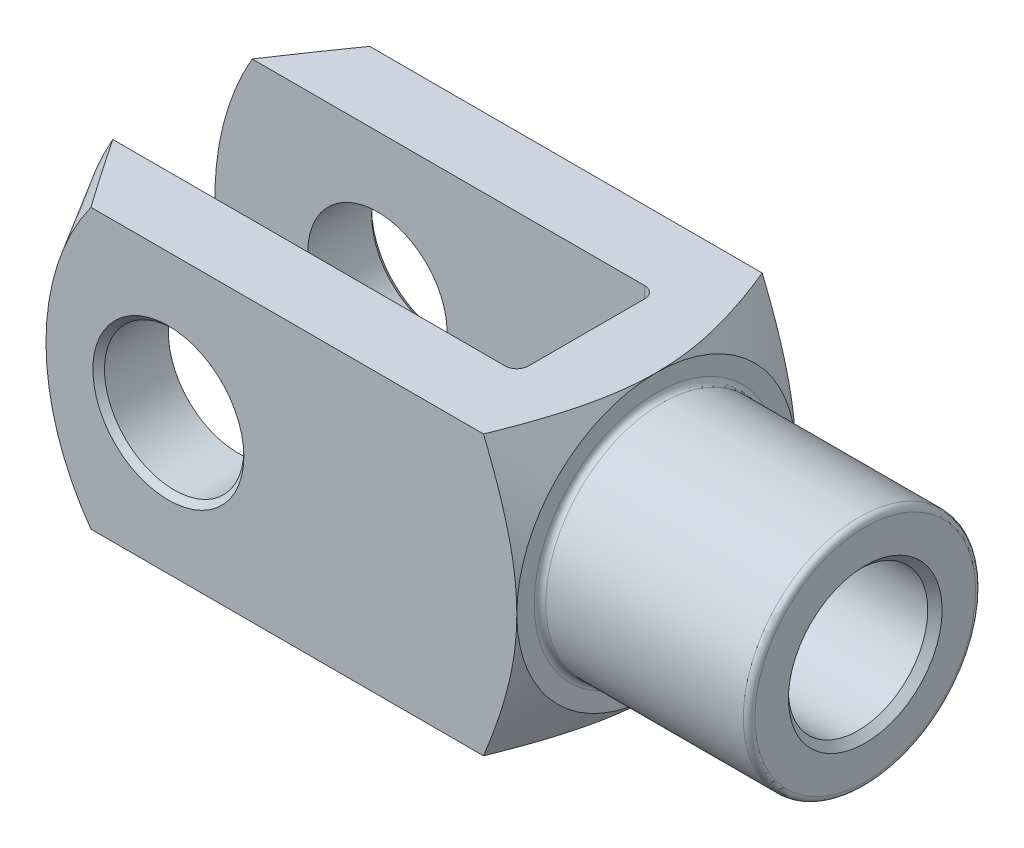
ISO-10303-21;
HEADER;
FILE_DESCRIPTION(('STEP AP214'),'2;1');
FILE_NAME('part.step','',(''),(''),'','','');
FILE_SCHEMA(('AUTOMOTIVE_DESIGN { 1 0 10303 214 1 1 1 1 }'));
ENDSEC;
DATA;
#1=APPLICATION_CONTEXT('core data for automotive mechanical design processes');
#2=APPLICATION_PROTOCOL_DEFINITION('international standard','automotive_design',2000,#1);
#3=PRODUCT_CONTEXT('',#1,'mechanical');
#4=PRODUCT('Part','Part','',(#3));
#5=PRODUCT_RELATED_PRODUCT_CATEGORY('part','',(#4));
#6=PRODUCT_DEFINITION_FORMATION('','',#4);
#7=PRODUCT_DEFINITION_CONTEXT('part definition',#1,'design');
#8=PRODUCT_DEFINITION('design','',#6,#7);
#9=PRODUCT_DEFINITION_SHAPE('','',#8);
#10=(LENGTH_UNIT() NAMED_UNIT(*) SI_UNIT(.MILLI.,.METRE.));
#11=(NAMED_UNIT(*) PLANE_ANGLE_UNIT() SI_UNIT($,.RADIAN.));
#12=(NAMED_UNIT(*) SI_UNIT($,.STERADIAN.) SOLID_ANGLE_UNIT());
#13=UNCERTAINTY_MEASURE_WITH_UNIT(LENGTH_MEASURE(1.E-05),#10,'distance_accuracy_value','');
#14=(GEOMETRIC_REPRESENTATION_CONTEXT(3) GLOBAL_UNCERTAINTY_ASSIGNED_CONTEXT((#13)) GLOBAL_UNIT_ASSIGNED_CONTEXT((#10,
#11,#12)) REPRESENTATION_CONTEXT('',''));
#15=CARTESIAN_POINT('',(0.,0.,0.));
#16=DIRECTION('',(0.,0.,1.));
#17=DIRECTION('',(1.,0.,0.));
#18=AXIS2_PLACEMENT_3D('',#15,#16,#17);
#19=CARTESIAN_POINT('',(-25.,-12.,-4.99999999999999));
#20=DIRECTION('',(0.,-1.,0.));
#21=DIRECTION('',(0.,0.,-1.));
#22=AXIS2_PLACEMENT_3D('',#19,#20,#21);
#23=CYLINDRICAL_SURFACE('',#22,1.);
#24=DIRECTION('',(0.,1.,0.));
#25=VECTOR('',#24,1.);
#26=CARTESIAN_POINT('',(-24.,-12.,-4.99999999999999));
#27=LINE('',#26,#25);
#28=CARTESIAN_POINT('',(-24.,-3.31662479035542,-4.99999999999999));
#29=VERTEX_POINT('',#28);
#30=CARTESIAN_POINT('',(-24.,-12.,-4.99999999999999));
#31=VERTEX_POINT('',#30);
#32=EDGE_CURVE('E357',#29,#31,#27,.F.);
#33=ORIENTED_EDGE('',*,*,#32,.F.);
#34=CARTESIAN_POINT('',(-24.,-3.31662479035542,-4.99999999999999));
#35=CARTESIAN_POINT('',(-24.000039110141,-3.2458892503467,-5.04693073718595));
#36=CARTESIAN_POINT('',(-24.0032998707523,-3.17421071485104,-5.0923055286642));
#37=CARTESIAN_POINT('',(-24.0152871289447,-3.02944292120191,-5.17972843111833));
#38=CARTESIAN_POINT('',(-24.0240049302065,-2.95635608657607,-5.22178171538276));
#39=CARTESIAN_POINT('',(-24.0458771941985,-2.80940810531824,-5.30228419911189));
#40=CARTESIAN_POINT('',(-24.0590080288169,-2.73555307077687,-5.34075122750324));
#41=CARTESIAN_POINT('',(-24.0890023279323,-2.58689159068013,-5.41432119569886));
#42=CARTESIAN_POINT('',(-24.1058679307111,-2.51208462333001,-5.44942219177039));
#43=CARTESIAN_POINT('',(-24.1575747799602,-2.30106419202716,-5.54321172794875));
#44=CARTESIAN_POINT('',(-24.1959404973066,-2.16400188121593,-5.59808248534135));
#45=CARTESIAN_POINT('',(-24.2800168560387,-1.88823561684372,-5.69702137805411));
#46=CARTESIAN_POINT('',(-24.3257315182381,-1.74953080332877,-5.74108356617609));
#47=CARTESIAN_POINT('',(-24.422565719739,-1.47057265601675,-5.81880111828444));
#48=CARTESIAN_POINT('',(-24.4737025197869,-1.33031573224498,-5.85242182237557));
#49=CARTESIAN_POINT('',(-24.579554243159,-1.04914006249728,-5.90930382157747));
#50=CARTESIAN_POINT('',(-24.634267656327,-0.908221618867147,-5.9325694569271));
#51=CARTESIAN_POINT('',(-24.7396434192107,-0.64175617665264,-5.96691885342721));
#52=CARTESIAN_POINT('',(-24.7900743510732,-0.516252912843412,-5.97907412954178));
#53=CARTESIAN_POINT('',(-24.891718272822,-0.265271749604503,-5.99544962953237));
#54=CARTESIAN_POINT('',(-24.9429298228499,-0.139794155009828,-5.99968301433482));
#55=CARTESIAN_POINT('',(-24.9960964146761,-0.00956179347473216,-5.99999428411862));
#56=CARTESIAN_POINT('',(-24.9980482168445,-0.00478087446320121,-5.99999999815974));
#57=CARTESIAN_POINT('',(-25.,0.,-6.));
#58=B_SPLINE_CURVE_WITH_KNOTS('',3,(#34,#35,#36,#37,#38,#39,#40,#41,#42,#43,#44,#45,#46,#47,#48,
#49,#50,#51,#52,#53,#54,#55,#56,#57),.UNSPECIFIED.,.F.,.F.,(4,2,2,2,2,2,2,2,2,2,2,4),(0.,
0.254478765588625,0.508553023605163,0.76128804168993,1.01416813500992,1.47107229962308,
1.92822730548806,2.38688397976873,2.8453482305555,3.25253093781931,3.65903657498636,
3.67452851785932),.UNSPECIFIED.);
#59=CARTESIAN_POINT('',(-25.,0.,-6.));
#60=VERTEX_POINT('',#59);
#61=EDGE_CURVE('E389',#29,#60,#58,.T.);
#62=ORIENTED_EDGE('',*,*,#61,.T.);
#63=DIRECTION('',(0.,1.,0.));
#64=VECTOR('',#63,1.);
#65=CARTESIAN_POINT('',(-25.,12.,-5.99999999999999));
#66=LINE('',#65,#64);
#67=CARTESIAN_POINT('',(-25.,-12.,-5.99999999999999));
#68=VERTEX_POINT('',#67);
#69=EDGE_CURVE('E183',#68,#60,#66,.T.);
#70=ORIENTED_EDGE('',*,*,#69,.F.);
#71=CARTESIAN_POINT('',(-25.,-12.,-4.99999999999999));
#72=DIRECTION('',(0.,-1.,0.));
#73=DIRECTION('',(0.,0.,-1.));
#74=AXIS2_PLACEMENT_3D('',#71,#72,#73);
#75=CIRCLE('',#74,1.);
#76=EDGE_CURVE('E197',#31,#68,#75,.F.);
#77=ORIENTED_EDGE('',*,*,#76,.F.);
#78=EDGE_LOOP('',(#33,#62,#70,#77));
#79=FACE_BOUND('',#78,.T.);
#80=ADVANCED_FACE('F37',(#79),#23,.F.);
#81=CARTESIAN_POINT('',(-24.,-12.,-5.99999999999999));
#82=DIRECTION('',(1.,0.,0.));
#83=DIRECTION('',(0.,0.,-1.));
#84=AXIS2_PLACEMENT_3D('',#81,#82,#83);
#85=PLANE('',#84);
#86=CARTESIAN_POINT('',(-24.,12.,-4.99999999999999));
#87=VERTEX_POINT('',#86);
#88=CARTESIAN_POINT('',(-24.,3.31662479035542,-4.99999999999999));
#89=VERTEX_POINT('',#88);
#90=EDGE_CURVE('E373',#87,#89,#27,.F.);
#91=ORIENTED_EDGE('',*,*,#90,.T.);
#92=CARTESIAN_POINT('',(-24.,0.,0.));
#93=DIRECTION('',(1.,0.,0.));
#94=DIRECTION('',(0.,0.,-1.));
#95=AXIS2_PLACEMENT_3D('',#92,#93,#94);
#96=CIRCLE('',#95,6.);
#97=CARTESIAN_POINT('',(-24.,3.31662479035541,5.));
#98=VERTEX_POINT('',#97);
#99=EDGE_CURVE('E715',#89,#98,#96,.T.);
#100=ORIENTED_EDGE('',*,*,#99,.T.);
#101=DIRECTION('',(0.,1.,0.));
#102=VECTOR('',#101,1.);
#103=CARTESIAN_POINT('',(-24.,12.,5.));
#104=LINE('',#103,#102);
#105=CARTESIAN_POINT('',(-24.,12.,5.));
#106=VERTEX_POINT('',#105);
#107=EDGE_CURVE('E160',#98,#106,#104,.T.);
#108=ORIENTED_EDGE('',*,*,#107,.T.);
#109=DIRECTION('',(0.,0.,-1.));
#110=VECTOR('',#109,1.);
#111=CARTESIAN_POINT('',(-24.,12.,-5.99999999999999));
#112=LINE('',#111,#110);
#113=EDGE_CURVE('E338',#106,#87,#112,.T.);
#114=ORIENTED_EDGE('',*,*,#113,.T.);
#115=EDGE_LOOP('',(#91,#100,#108,#114));
#116=FACE_BOUND('',#115,.T.);
#117=ADVANCED_FACE('F439',(#116),#85,.F.);
#118=CARTESIAN_POINT('',(-25.,-12.,5.));
#119=DIRECTION('',(0.,-1.,0.));
#120=DIRECTION('',(0.,0.,-1.));
#121=AXIS2_PLACEMENT_3D('',#118,#119,#120);
#122=CYLINDRICAL_SURFACE('',#121,1.);
#123=ORIENTED_EDGE('',*,*,#107,.F.);
#124=CARTESIAN_POINT('',(-24.,3.31662479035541,5.));
#125=CARTESIAN_POINT('',(-24.000039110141,3.24588925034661,5.04693073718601));
#126=CARTESIAN_POINT('',(-24.0032998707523,3.17421071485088,5.0923055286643));
#127=CARTESIAN_POINT('',(-24.0152871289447,3.02944292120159,5.17972843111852));
#128=CARTESIAN_POINT('',(-24.0240049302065,2.95635608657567,5.22178171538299));
#129=CARTESIAN_POINT('',(-24.0458771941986,2.80940810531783,5.30228419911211));
#130=CARTESIAN_POINT('',(-24.0590080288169,2.73555307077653,5.34075122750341));
#131=CARTESIAN_POINT('',(-24.0890023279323,2.58689159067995,5.41432119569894));
#132=CARTESIAN_POINT('',(-24.1058679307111,2.51208462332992,5.44942219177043));
#133=CARTESIAN_POINT('',(-24.1575747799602,2.30106419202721,5.54321172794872));
#134=CARTESIAN_POINT('',(-24.1959404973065,2.16400188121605,5.5980824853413));
#135=CARTESIAN_POINT('',(-24.2800168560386,1.88823561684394,5.69702137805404));
#136=CARTESIAN_POINT('',(-24.3257315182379,1.74953080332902,5.741083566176));
#137=CARTESIAN_POINT('',(-24.422565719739,1.47057265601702,5.81880111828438));
#138=CARTESIAN_POINT('',(-24.473702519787,1.33031573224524,5.85242182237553));
#139=CARTESIAN_POINT('',(-24.5795542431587,1.04914006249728,5.90930382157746));
#140=CARTESIAN_POINT('',(-24.6342676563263,0.908221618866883,5.93256945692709));
#141=CARTESIAN_POINT('',(-24.7396434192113,0.64175617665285,5.96691885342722));
#142=CARTESIAN_POINT('',(-24.7900743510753,0.516252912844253,5.97907412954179));
#143=CARTESIAN_POINT('',(-24.8917182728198,0.265271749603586,5.99544962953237));
#144=CARTESIAN_POINT('',(-24.9429298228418,0.139794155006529,5.9996830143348));
#145=CARTESIAN_POINT('',(-24.9960964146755,0.00956179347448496,5.99999428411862));
#146=CARTESIAN_POINT('',(-24.9980482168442,0.00478087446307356,5.99999999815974));
#147=CARTESIAN_POINT('',(-25.,0.,6.));
#148=B_SPLINE_CURVE_WITH_KNOTS('',3,(#124,#125,#126,#127,#128,#129,#130,#131,#132,#133,#134,
#135,#136,#137,#138,#139,#140,#141,#142,#143,#144,#145,#146,#147),.UNSPECIFIED.,.F.,.F.,(4,2,2,
2,2,2,2,2,2,2,2,4),(0.,0.25447876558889,0.508553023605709,0.76128804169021,1.01416813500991,
1.47107229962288,1.92822730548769,2.38688397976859,2.84534823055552,3.25253093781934,
3.65903657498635,3.67452851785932),.UNSPECIFIED.);
#149=CARTESIAN_POINT('',(-25.,0.,6.));
#150=VERTEX_POINT('',#149);
#151=EDGE_CURVE('E145',#98,#150,#148,.T.);
#152=ORIENTED_EDGE('',*,*,#151,.T.);
#153=DIRECTION('',(0.,1.,0.));
#154=VECTOR('',#153,1.);
#155=CARTESIAN_POINT('',(-25.,-12.,6.));
#156=LINE('',#155,#154);
#157=CARTESIAN_POINT('',(-25.,12.,6.));
#158=VERTEX_POINT('',#157);
#159=EDGE_CURVE('E159',#158,#150,#156,.F.);
#160=ORIENTED_EDGE('',*,*,#159,.F.);
#161=CARTESIAN_POINT('',(-25.,12.,5.));
#162=DIRECTION('',(0.,1.,0.));
#163=DIRECTION('',(0.,0.,1.));
#164=AXIS2_PLACEMENT_3D('',#161,#162,#163);
#165=CIRCLE('',#164,1.);
#166=EDGE_CURVE('E189',#106,#158,#165,.F.);
#167=ORIENTED_EDGE('',*,*,#166,.F.);
#168=EDGE_LOOP('',(#123,#152,#160,#167));
#169=FACE_BOUND('',#168,.T.);
#170=ADVANCED_FACE('F156',(#169),#122,.F.);
#171=CARTESIAN_POINT('',(-62.,-12.,-5.99999999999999));
#172=DIRECTION('',(0.,0.,-1.));
#173=DIRECTION('',(-1.,0.,0.));
#174=AXIS2_PLACEMENT_3D('',#171,#172,#173);
#175=PLANE('',#174);
#176=CARTESIAN_POINT('',(-48.,0.,-5.99999999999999));
#177=DIRECTION('',(0.,0.,-1.));
#178=DIRECTION('',(-1.,0.,0.));
#179=AXIS2_PLACEMENT_3D('',#176,#177,#178);
#180=CIRCLE('',#179,6.);
#181=CARTESIAN_POINT('',(-54.,0.,-5.99999999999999));
#182=VERTEX_POINT('',#181);
#183=EDGE_CURVE('E367',#182,#182,#180,.F.);
#184=ORIENTED_EDGE('',*,*,#183,.F.);
#185=EDGE_LOOP('',(#184));
#186=FACE_BOUND('',#185,.T.);
#187=CARTESIAN_POINT('',(-38.,0.,-5.99999999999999));
#188=DIRECTION('',(0.,0.,1.));
#189=DIRECTION('',(1.,0.,0.));
#190=AXIS2_PLACEMENT_3D('',#187,#188,#189);
#191=CIRCLE('',#190,24.);
#192=CARTESIAN_POINT('',(-58.7846096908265,12.,-5.99999999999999));
#193=VERTEX_POINT('',#192);
#194=CARTESIAN_POINT('',(-58.7846096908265,-12.,-5.99999999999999));
#195=VERTEX_POINT('',#194);
#196=EDGE_CURVE('E276',#193,#195,#191,.T.);
#197=ORIENTED_EDGE('',*,*,#196,.T.);
#198=DIRECTION('',(-1.,0.,0.));
#199=VECTOR('',#198,1.);
#200=CARTESIAN_POINT('',(-62.,-12.,-5.99999999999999));
#201=LINE('',#200,#199);
#202=EDGE_CURVE('E333',#68,#195,#201,.T.);
#203=ORIENTED_EDGE('',*,*,#202,.F.);
#204=ORIENTED_EDGE('',*,*,#69,.T.);
#205=CARTESIAN_POINT('',(-25.,12.,-5.99999999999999));
#206=VERTEX_POINT('',#205);
#207=EDGE_CURVE('E179',#60,#206,#66,.T.);
#208=ORIENTED_EDGE('',*,*,#207,.T.);
#209=DIRECTION('',(-1.,0.,0.));
#210=VECTOR('',#209,1.);
#211=CARTESIAN_POINT('',(-62.,12.,-5.99999999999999));
#212=LINE('',#211,#210);
#213=EDGE_CURVE('E346',#206,#193,#212,.T.);
#214=ORIENTED_EDGE('',*,*,#213,.T.);
#215=EDGE_LOOP('',(#197,#203,#204,#208,#214));
#216=FACE_BOUND('',#215,.T.);
#217=ADVANCED_FACE('F392',(#186,#216),#175,.F.);
#218=CARTESIAN_POINT('',(-62.,-12.,6.00000000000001));
#219=DIRECTION('',(0.,0.,1.));
#220=DIRECTION('',(1.,0.,0.));
#221=AXIS2_PLACEMENT_3D('',#218,#219,#220);
#222=PLANE('',#221);
#223=CARTESIAN_POINT('',(-48.,0.,6.));
#224=DIRECTION('',(0.,0.,1.));
#225=DIRECTION('',(1.,0.,0.));
#226=AXIS2_PLACEMENT_3D('',#223,#224,#225);
#227=CIRCLE('',#226,6.);
#228=CARTESIAN_POINT('',(-42.,0.,6.));
#229=VERTEX_POINT('',#228);
#230=EDGE_CURVE('E345',#229,#229,#227,.F.);
#231=ORIENTED_EDGE('',*,*,#230,.F.);
#232=EDGE_LOOP('',(#231));
#233=FACE_BOUND('',#232,.T.);
#234=DIRECTION('',(1.,0.,0.));
#235=VECTOR('',#234,1.);
#236=CARTESIAN_POINT('',(-62.,-12.,6.00000000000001));
#237=LINE('',#236,#235);
#238=CARTESIAN_POINT('',(-58.7846096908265,-12.,6.00000000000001));
#239=VERTEX_POINT('',#238);
#240=CARTESIAN_POINT('',(-25.,-12.,6.));
#241=VERTEX_POINT('',#240);
#242=EDGE_CURVE('E337',#239,#241,#237,.T.);
#243=ORIENTED_EDGE('',*,*,#242,.F.);
#244=CARTESIAN_POINT('',(-38.,0.,6.00000000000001));
#245=DIRECTION('',(0.,0.,1.));
#246=DIRECTION('',(1.,0.,0.));
#247=AXIS2_PLACEMENT_3D('',#244,#245,#246);
#248=CIRCLE('',#247,24.);
#249=CARTESIAN_POINT('',(-58.7846096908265,12.,6.00000000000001));
#250=VERTEX_POINT('',#249);
#251=EDGE_CURVE('E414',#250,#239,#248,.T.);
#252=ORIENTED_EDGE('',*,*,#251,.F.);
#253=DIRECTION('',(1.,0.,0.));
#254=VECTOR('',#253,1.);
#255=CARTESIAN_POINT('',(-62.,12.,6.00000000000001));
#256=LINE('',#255,#254);
#257=EDGE_CURVE('E176',#250,#158,#256,.T.);
#258=ORIENTED_EDGE('',*,*,#257,.T.);
#259=ORIENTED_EDGE('',*,*,#159,.T.);
#260=EDGE_CURVE('E164',#150,#241,#156,.F.);
#261=ORIENTED_EDGE('',*,*,#260,.T.);
#262=EDGE_LOOP('',(#243,#252,#258,#259,#261));
#263=FACE_BOUND('',#262,.T.);
#264=ADVANCED_FACE('F173',(#233,#263),#222,.F.);
#265=CARTESIAN_POINT('',(-62.,-12.,12.));
#266=DIRECTION('',(0.,0.,1.));
#267=DIRECTION('',(1.,0.,0.));
#268=AXIS2_PLACEMENT_3D('',#265,#266,#267);
#269=PLANE('',#268);
#270=CARTESIAN_POINT('',(-48.,0.,12.));
#271=DIRECTION('',(0.,0.,1.));
#272=DIRECTION('',(1.,0.,0.));
#273=AXIS2_PLACEMENT_3D('',#270,#271,#272);
#274=CIRCLE('',#273,6.50000000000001);
#275=CARTESIAN_POINT('',(-41.5,0.,12.));
#276=VERTEX_POINT('',#275);
#277=EDGE_CURVE('E228',#276,#276,#274,.F.);
#278=ORIENTED_EDGE('',*,*,#277,.T.);
#279=EDGE_LOOP('',(#278));
#280=FACE_BOUND('',#279,.T.);
#281=DIRECTION('',(1.,0.,0.));
#282=VECTOR('',#281,1.);
#283=CARTESIAN_POINT('',(-62.,12.,12.));
#284=LINE('',#283,#282);
#285=CARTESIAN_POINT('',(-54.6650269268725,12.,12.));
#286=VERTEX_POINT('',#285);
#287=CARTESIAN_POINT('',(-20.8697557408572,12.,12.));
#288=VERTEX_POINT('',#287);
#289=EDGE_CURVE('E364',#286,#288,#284,.T.);
#290=ORIENTED_EDGE('',*,*,#289,.F.);
#291=CARTESIAN_POINT('',(-38.,0.,12.));
#292=DIRECTION('',(0.,0.,1.));
#293=DIRECTION('',(1.,0.,0.));
#294=AXIS2_PLACEMENT_3D('',#291,#292,#293);
#295=CIRCLE('',#294,20.5358983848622);
#296=CARTESIAN_POINT('',(-54.6650269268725,-12.,12.));
#297=VERTEX_POINT('',#296);
#298=EDGE_CURVE('E61',#286,#297,#295,.T.);
#299=ORIENTED_EDGE('',*,*,#298,.T.);
#300=DIRECTION('',(1.,0.,0.));
#301=VECTOR('',#300,1.);
#302=CARTESIAN_POINT('',(-62.,-12.,12.));
#303=LINE('',#302,#301);
#304=CARTESIAN_POINT('',(-20.8697557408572,-12.,12.));
#305=VERTEX_POINT('',#304);
#306=EDGE_CURVE('E361',#297,#305,#303,.T.);
#307=ORIENTED_EDGE('',*,*,#306,.T.);
#308=CARTESIAN_POINT('',(-26.8270481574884,-24.508852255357,12.));
#309=CARTESIAN_POINT('',(-26.5204158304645,-23.9174203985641,12.));
#310=CARTESIAN_POINT('',(-26.2154046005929,-23.3251403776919,12.));
#311=CARTESIAN_POINT('',(-25.6094839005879,-22.1384473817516,12.));
#312=CARTESIAN_POINT('',(-25.3085746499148,-21.5440342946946,12.));
#313=CARTESIAN_POINT('',(-24.7112306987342,-20.3516642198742,12.));
#314=CARTESIAN_POINT('',(-24.4148047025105,-19.753702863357,12.));
#315=CARTESIAN_POINT('',(-23.8281918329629,-18.5547362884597,12.));
#316=CARTESIAN_POINT('',(-23.5380048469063,-17.9537311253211,12.));
#317=CARTESIAN_POINT('',(-22.9478447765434,-16.7109015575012,12.));
#318=CARTESIAN_POINT('',(-22.6483679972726,-16.0688406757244,12.));
#319=CARTESIAN_POINT('',(-22.0608191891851,-14.7794664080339,12.));
#320=CARTESIAN_POINT('',(-21.7727477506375,-14.132152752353,12.));
#321=CARTESIAN_POINT('',(-21.211729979,-12.8312921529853,12.));
#322=CARTESIAN_POINT('',(-20.9387769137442,-12.177748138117,12.));
#323=CARTESIAN_POINT('',(-20.5444276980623,-11.1914316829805,12.));
#324=CARTESIAN_POINT('',(-20.4154954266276,-10.8616706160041,12.));
#325=CARTESIAN_POINT('',(-20.1634870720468,-10.1999223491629,12.));
#326=CARTESIAN_POINT('',(-20.0404108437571,-9.867935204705,12.));
#327=CARTESIAN_POINT('',(-19.7750973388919,-9.12924658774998,12.));
#328=CARTESIAN_POINT('',(-19.6344928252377,-8.72195527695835,12.));
#329=CARTESIAN_POINT('',(-19.3653837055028,-7.90341175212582,12.));
#330=CARTESIAN_POINT('',(-19.2368780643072,-7.4921598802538,12.));
#331=CARTESIAN_POINT('',(-18.99435151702,-6.66538582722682,12.));
#332=CARTESIAN_POINT('',(-18.8803303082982,-6.24986373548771,12.));
#333=CARTESIAN_POINT('',(-18.6694959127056,-5.41444148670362,12.));
#334=CARTESIAN_POINT('',(-18.5726825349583,-4.99454137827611,12.));
#335=CARTESIAN_POINT('',(-18.4012191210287,-4.16046851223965,12.));
#336=CARTESIAN_POINT('',(-18.3261021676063,-3.74639268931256,12.));
#337=CARTESIAN_POINT('',(-18.1977094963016,-2.91483992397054,12.));
#338=CARTESIAN_POINT('',(-18.1444330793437,-2.49736309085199,12.));
#339=CARTESIAN_POINT('',(-18.061948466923,-1.66028284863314,12.));
#340=CARTESIAN_POINT('',(-18.032724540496,-1.24068101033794,12.));
#341=CARTESIAN_POINT('',(-17.9996341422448,-0.400474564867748,12.));
#342=CARTESIAN_POINT('',(-17.9957667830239,0.0201300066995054,12.));
#343=CARTESIAN_POINT('',(-18.0129154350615,0.830148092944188,12.));
#344=CARTESIAN_POINT('',(-18.0321388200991,1.2196011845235,12.));
#345=CARTESIAN_POINT('',(-18.091746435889,1.99686728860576,12.));
#346=CARTESIAN_POINT('',(-18.1321306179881,2.38468030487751,12.));
#347=CARTESIAN_POINT('',(-18.232579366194,3.15792367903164,12.));
#348=CARTESIAN_POINT('',(-18.2926540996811,3.54335270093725,12.));
#349=CARTESIAN_POINT('',(-18.4305032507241,4.31101186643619,12.));
#350=CARTESIAN_POINT('',(-18.5082781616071,4.69324192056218,12.));
#351=CARTESIAN_POINT('',(-18.6818401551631,5.46519444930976,12.));
#352=CARTESIAN_POINT('',(-18.7780834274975,5.85481356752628,12.));
#353=CARTESIAN_POINT('',(-18.9846981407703,6.63026168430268,12.));
#354=CARTESIAN_POINT('',(-19.0950697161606,7.01609064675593,12.));
#355=CARTESIAN_POINT('',(-19.327805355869,7.78407900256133,12.));
#356=CARTESIAN_POINT('',(-19.450168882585,8.16623855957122,12.));
#357=CARTESIAN_POINT('',(-19.6413066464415,8.73690278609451,12.));
#358=CARTESIAN_POINT('',(-19.706283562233,8.92669203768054,12.));
#359=CARTESIAN_POINT('',(-19.8385670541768,9.30545658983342,12.));
#360=CARTESIAN_POINT('',(-19.9058736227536,9.49443189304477,12.));
#361=CARTESIAN_POINT('',(-20.1221378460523,10.09093133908,12.));
#362=CARTESIAN_POINT('',(-20.2750221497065,10.4970351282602,12.));
#363=CARTESIAN_POINT('',(-20.5890916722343,11.3060297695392,12.));
#364=CARTESIAN_POINT('',(-20.750277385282,11.7089204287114,12.));
#365=CARTESIAN_POINT('',(-21.0796092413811,12.5119467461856,12.));
#366=CARTESIAN_POINT('',(-21.2477569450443,12.9120817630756,12.));
#367=CARTESIAN_POINT('',(-21.5898549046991,13.7098486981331,12.));
#368=CARTESIAN_POINT('',(-21.7638050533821,14.1074806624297,12.));
#369=CARTESIAN_POINT('',(-22.1167497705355,14.900905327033,12.));
#370=CARTESIAN_POINT('',(-22.2957485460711,15.296696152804,12.));
#371=CARTESIAN_POINT('',(-22.6579079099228,16.0863711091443,12.));
#372=CARTESIAN_POINT('',(-22.841068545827,16.4802552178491,12.));
#373=CARTESIAN_POINT('',(-23.3958010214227,17.6593177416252,12.));
#374=CARTESIAN_POINT('',(-23.7726679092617,18.4420054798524,12.));
#375=CARTESIAN_POINT('',(-24.5379796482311,20.004634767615,12.));
#376=CARTESIAN_POINT('',(-24.9264562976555,20.7845606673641,12.));
#377=CARTESIAN_POINT('',(-25.7113669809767,22.3404133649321,12.));
#378=CARTESIAN_POINT('',(-26.107801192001,23.1163400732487,12.));
#379=CARTESIAN_POINT('',(-26.9066094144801,24.6646398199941,12.));
#380=CARTESIAN_POINT('',(-27.3089803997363,25.4370144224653,12.));
#381=CARTESIAN_POINT('',(-28.1185505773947,26.9792185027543,12.));
#382=CARTESIAN_POINT('',(-28.5257497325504,27.7490480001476,12.));
#383=CARTESIAN_POINT('',(-29.6315922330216,29.8271201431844,12.));
#384=CARTESIAN_POINT('',(-30.3338843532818,31.1334202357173,12.));
#385=CARTESIAN_POINT('',(-31.7463886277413,33.7419610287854,12.));
#386=CARTESIAN_POINT('',(-32.4566018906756,35.0442011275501,12.));
#387=CARTESIAN_POINT('',(-33.8786764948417,37.6380871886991,12.));
#388=CARTESIAN_POINT('',(-34.5905050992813,38.9297511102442,12.));
#389=CARTESIAN_POINT('',(-35.6613936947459,40.865371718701,12.));
#390=CARTESIAN_POINT('',(-36.0188525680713,41.5102153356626,12.));
#391=CARTESIAN_POINT('',(-36.7347123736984,42.7993785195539,12.));
#392=CARTESIAN_POINT('',(-37.0931133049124,43.4436980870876,12.));
#393=CARTESIAN_POINT('',(-37.4519232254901,44.0877898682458,12.));
#394=B_SPLINE_CURVE_WITH_KNOTS('',3,(#308,#309,#310,#311,#312,#313,#314,#315,#316,#317,#318,
#319,#320,#321,#322,#323,#324,#325,#326,#327,#328,#329,#330,#331,#332,#333,#334,#335,#336,#337,
#338,#339,#340,#341,#342,#343,#344,#345,#346,#347,#348,#349,#350,#351,#352,#353,#354,#355,#356,
#357,#358,#359,#360,#361,#362,#363,#364,#365,#366,#367,#368,#369,#370,#371,#372,#373,#374,#375,
#376,#377,#378,#379,#380,#381,#382,#383,#384,#385,#386,#387,#388,#389,#390,#391,#392,#393),
.UNSPECIFIED.,.F.,.F.,(4,2,2,2,2,2,2,2,2,2,2,2,2,2,2,2,2,2,2,2,2,2,2,2,2,2,2,2,2,2,2,2,2,2,2,2,
2,2,2,2,2,2,4),(0.,1.99859095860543,3.99728842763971,5.99946635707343,8.00160807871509,
10.1269271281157,12.2523560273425,14.3768307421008,15.4389968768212,16.501136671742,
17.793611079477,19.0859748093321,20.3783115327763,21.6706339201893,22.9326201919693,
24.194566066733,25.4556859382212,26.7167616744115,27.8859474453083,29.0551305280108,
30.2249182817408,31.3947386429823,32.5984184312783,33.8021096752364,35.0057469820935,
35.6075466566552,36.209344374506,37.51100701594,38.8127472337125,40.1147808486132,
41.4167903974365,42.719918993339,44.0230624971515,46.6290236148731,49.2429304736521,
51.8568955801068,54.469571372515,57.082227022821,61.5315331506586,65.9814700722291,
70.4059202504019,72.6177970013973,74.829671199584),.UNSPECIFIED.);
#395=CARTESIAN_POINT('',(-18.,0.,12.));
#396=VERTEX_POINT('',#395);
#397=EDGE_CURVE('E305',#396,#305,#394,.F.);
#398=ORIENTED_EDGE('',*,*,#397,.F.);
#399=EDGE_CURVE('E303',#288,#396,#394,.F.);
#400=ORIENTED_EDGE('',*,*,#399,.F.);
#401=EDGE_LOOP('',(#290,#299,#307,#398,#400));
#402=FACE_BOUND('',#401,.T.);
#403=ADVANCED_FACE('F287',(#280,#402),#269,.T.);
#404=CARTESIAN_POINT('',(-62.,-12.,12.));
#405=DIRECTION('',(0.,-1.,0.));
#406=DIRECTION('',(0.,0.,-1.));
#407=AXIS2_PLACEMENT_3D('',#404,#405,#406);
#408=PLANE('',#407);
#409=ORIENTED_EDGE('',*,*,#202,.T.);
#410=CARTESIAN_POINT('',(-68.2786029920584,-12.,8.84338025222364));
#411=CARTESIAN_POINT('',(-67.6947368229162,-12.,7.90330325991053));
#412=CARTESIAN_POINT('',(-67.1092717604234,-12.,6.96421474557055));
#413=CARTESIAN_POINT('',(-65.9343954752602,-12.,5.08848378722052));
#414=CARTESIAN_POINT('',(-65.3449841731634,-12.,4.15184139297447));
#415=CARTESIAN_POINT('',(-64.1607841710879,-12.,2.28039346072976));
#416=CARTESIAN_POINT('',(-63.565989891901,-12.,1.34559145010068));
#417=CARTESIAN_POINT('',(-62.3707199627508,-12.,-0.520365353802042));
#418=CARTESIAN_POINT('',(-61.7702443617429,-12.,-1.45152017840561));
#419=CARTESIAN_POINT('',(-60.53715948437,-12.,-3.34796497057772));
#420=CARTESIAN_POINT('',(-59.9042532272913,-12.,-4.31306203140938));
#421=CARTESIAN_POINT('',(-58.6288928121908,-12.,-6.23692872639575));
#422=CARTESIAN_POINT('',(-57.9864387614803,-12.,-7.1956984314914));
#423=CARTESIAN_POINT('',(-57.0137395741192,-12.,-8.62721356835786));
#424=CARTESIAN_POINT('',(-56.6881242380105,-12.,-9.103105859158));
#425=CARTESIAN_POINT('',(-56.0333476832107,-12.,-10.0524433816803));
#426=CARTESIAN_POINT('',(-55.7041864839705,-12.,-10.5258886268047));
#427=CARTESIAN_POINT('',(-55.0417887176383,-12.,-11.4698924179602));
#428=CARTESIAN_POINT('',(-54.708552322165,-12.,-11.9404510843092));
#429=CARTESIAN_POINT('',(-54.037326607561,-12.,-12.8781628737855));
#430=CARTESIAN_POINT('',(-53.6993373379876,-12.,-13.3453160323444));
#431=CARTESIAN_POINT('',(-53.020956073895,-12.,-14.2712057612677));
#432=CARTESIAN_POINT('',(-52.6806158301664,-12.,-14.7299801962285));
#433=CARTESIAN_POINT('',(-51.9934550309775,-12.,-15.6426726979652));
#434=CARTESIAN_POINT('',(-51.6466343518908,-12.,-16.0965906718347));
#435=CARTESIAN_POINT('',(-50.9447774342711,-12.,-16.9990439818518));
#436=CARTESIAN_POINT('',(-50.589730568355,-12.,-17.447571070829));
#437=CARTESIAN_POINT('',(-49.8702804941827,-12.,-18.3370436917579));
#438=CARTESIAN_POINT('',(-49.5058777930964,-12.,-18.7779896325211));
#439=CARTESIAN_POINT('',(-48.7694365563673,-12.,-19.6456462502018));
#440=CARTESIAN_POINT('',(-48.3975164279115,-12.,-20.0724571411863));
#441=CARTESIAN_POINT('',(-47.6396530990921,-12.,-20.9137472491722));
#442=CARTESIAN_POINT('',(-47.2537063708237,-12.,-21.3282233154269));
#443=CARTESIAN_POINT('',(-46.6621255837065,-12.,-21.9367708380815));
#444=CARTESIAN_POINT('',(-46.4630426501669,-12.,-22.1372171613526));
#445=CARTESIAN_POINT('',(-46.0599745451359,-12.,-22.5331099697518));
#446=CARTESIAN_POINT('',(-45.8559896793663,-12.,-22.7285567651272));
#447=CARTESIAN_POINT('',(-45.4425971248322,-12.,-23.1134290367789));
#448=CARTESIAN_POINT('',(-45.2331922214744,-12.,-23.3028574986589));
#449=CARTESIAN_POINT('',(-44.8081788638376,-12.,-23.6745980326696));
#450=CARTESIAN_POINT('',(-44.592571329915,-12.,-23.8569111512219));
#451=CARTESIAN_POINT('',(-44.2600203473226,-12.,-24.1270885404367));
#452=CARTESIAN_POINT('',(-44.1456331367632,-12.,-24.2181054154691));
#453=CARTESIAN_POINT('',(-43.9148670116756,-12.,-24.3975755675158));
#454=CARTESIAN_POINT('',(-43.7984881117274,-12.,-24.4860288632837));
#455=CARTESIAN_POINT('',(-43.4461413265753,-12.,-24.7471697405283));
#456=CARTESIAN_POINT('',(-43.2069947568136,-12.,-24.9156125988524));
#457=CARTESIAN_POINT('',(-42.7195001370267,-12.,-25.2383188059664));
#458=CARTESIAN_POINT('',(-42.4711595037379,-12.,-25.3925932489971));
#459=CARTESIAN_POINT('',(-41.9645146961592,-12.,-25.6835963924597));
#460=CARTESIAN_POINT('',(-41.7062131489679,-12.,-25.8203296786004));
#461=CARTESIAN_POINT('',(-41.0356348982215,-12.,-26.1405466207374));
#462=CARTESIAN_POINT('',(-40.6158504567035,-12.,-26.3091476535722));
#463=CARTESIAN_POINT('',(-39.9703142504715,-12.,-26.5095003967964));
#464=CARTESIAN_POINT('',(-39.752581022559,-12.,-26.5675140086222));
#465=CARTESIAN_POINT('',(-39.3127569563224,-12.,-26.6640173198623));
#466=CARTESIAN_POINT('',(-39.0906663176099,-12.,-26.7025079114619));
#467=CARTESIAN_POINT('',(-38.6415790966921,-12.,-26.7585747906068));
#468=CARTESIAN_POINT('',(-38.4145556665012,-12.,-26.7759381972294));
#469=CARTESIAN_POINT('',(-37.9599023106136,-12.,-26.7882217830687));
#470=CARTESIAN_POINT('',(-37.7322724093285,-12.,-26.7831428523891));
#471=CARTESIAN_POINT('',(-37.2785688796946,-12.,-26.7507852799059));
#472=CARTESIAN_POINT('',(-37.0524955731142,-12.,-26.7235021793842));
#473=CARTESIAN_POINT('',(-36.6038899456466,-12.,-26.6479928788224));
#474=CARTESIAN_POINT('',(-36.3813581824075,-12.,-26.5997634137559));
#475=CARTESIAN_POINT('',(-35.9005519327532,-12.,-26.4736338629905));
#476=CARTESIAN_POINT('',(-35.6432890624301,-12.,-26.3918933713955));
#477=CARTESIAN_POINT('',(-35.1371308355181,-12.,-26.2055998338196));
#478=CARTESIAN_POINT('',(-34.8882402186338,-12.,-26.1010341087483));
#479=CARTESIAN_POINT('',(-34.3986617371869,-12.,-25.8726383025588));
#480=CARTESIAN_POINT('',(-34.1579999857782,-12.,-25.748752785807));
#481=CARTESIAN_POINT('',(-33.6854799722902,-12.,-25.485398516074));
#482=CARTESIAN_POINT('',(-33.4536207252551,-12.,-25.3459315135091));
#483=CARTESIAN_POINT('',(-32.9233788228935,-12.,-25.0064399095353));
#484=CARTESIAN_POINT('',(-32.6281184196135,-12.,-24.8015559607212));
#485=CARTESIAN_POINT('',(-32.0502738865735,-12.,-24.3745460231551));
#486=CARTESIAN_POINT('',(-31.7676958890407,-12.,-24.1524118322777));
#487=CARTESIAN_POINT('',(-31.213079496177,-12.,-23.6943719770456));
#488=CARTESIAN_POINT('',(-30.9410624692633,-12.,-23.4584405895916));
#489=CARTESIAN_POINT('',(-30.4066261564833,-12.,-22.9760898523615));
#490=CARTESIAN_POINT('',(-30.1442052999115,-12.,-22.7296722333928));
#491=CARTESIAN_POINT('',(-29.6258300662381,-12.,-22.2267453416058));
#492=CARTESIAN_POINT('',(-29.3699307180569,-12.,-21.9701795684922));
#493=CARTESIAN_POINT('',(-28.8652654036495,-12.,-21.4501311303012));
#494=CARTESIAN_POINT('',(-28.6164996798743,-12.,-21.1866482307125));
#495=CARTESIAN_POINT('',(-28.1253910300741,-12.,-20.6542828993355));
#496=CARTESIAN_POINT('',(-27.8830417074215,-12.,-20.3854063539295));
#497=CARTESIAN_POINT('',(-27.4036952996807,-12.,-19.8429441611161));
#498=CARTESIAN_POINT('',(-27.1666981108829,-12.,-19.5693586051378));
#499=CARTESIAN_POINT('',(-26.6001496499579,-12.,-18.9040671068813));
#500=CARTESIAN_POINT('',(-26.2729278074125,-12.,-18.5103784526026));
#501=CARTESIAN_POINT('',(-25.6261860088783,-12.,-17.7166170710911));
#502=CARTESIAN_POINT('',(-25.3066675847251,-12.,-17.3165430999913));
#503=CARTESIAN_POINT('',(-24.6790054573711,-12.,-16.5174455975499));
#504=CARTESIAN_POINT('',(-24.3707624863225,-12.,-16.1184998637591));
#505=CARTESIAN_POINT('',(-23.7597996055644,-12.,-15.316589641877));
#506=CARTESIAN_POINT('',(-23.457078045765,-12.,-14.9136264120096));
#507=CARTESIAN_POINT('',(-23.1566197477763,-12.,-14.5090044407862));
#508=B_SPLINE_CURVE_WITH_KNOTS('',3,(#410,#411,#412,#413,#414,#415,#416,#417,#418,#419,#420,
#421,#422,#423,#424,#425,#426,#427,#428,#429,#430,#431,#432,#433,#434,#435,#436,#437,#438,#439,
#440,#441,#442,#443,#444,#445,#446,#447,#448,#449,#450,#451,#452,#453,#454,#455,#456,#457,#458,
#459,#460,#461,#462,#463,#464,#465,#466,#467,#468,#469,#470,#471,#472,#473,#474,#475,#476,#477,
#478,#479,#480,#481,#482,#483,#484,#485,#486,#487,#488,#489,#490,#491,#492,#493,#494,#495,#496,
#497,#498,#499,#500,#501,#502,#503,#504,#505,#506,#507),.UNSPECIFIED.,.F.,.F.,(4,2,2,2,2,2,2,2,
2,2,2,2,2,2,2,2,2,2,2,2,2,2,2,2,2,2,2,2,2,2,2,2,2,2,2,2,2,2,2,2,2,2,2,2,2,2,2,2,4),(0.,
3.3199138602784,6.63989474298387,9.96383874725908,13.287754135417,16.7500600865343,
20.2123271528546,21.9421957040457,23.672054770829,25.401841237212,27.1316096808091,
28.845256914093,30.5589368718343,32.2749700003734,33.9909103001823,35.6890521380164,
37.3876240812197,38.2350900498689,39.0825033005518,39.9294893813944,40.7763504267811,
41.2148575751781,41.6533615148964,42.5304910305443,43.4069277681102,44.2831349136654,
45.6347123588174,46.309970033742,46.9851968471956,47.6671724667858,48.3491210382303,
49.0312065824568,49.713398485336,50.5219110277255,51.3308738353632,52.1422020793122,
52.9534392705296,54.0307393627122,55.1085548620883,56.1884481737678,57.2681639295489,
58.3551054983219,59.4420839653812,60.52793455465,61.6137640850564,63.1494038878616,
64.6853465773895,66.1977597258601,67.7097132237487),.UNSPECIFIED.);
#509=CARTESIAN_POINT('',(-54.6650269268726,-12.,-12.));
#510=VERTEX_POINT('',#509);
#511=EDGE_CURVE('E275',#195,#510,#508,.T.);
#512=ORIENTED_EDGE('',*,*,#511,.T.);
#513=DIRECTION('',(1.,0.,0.));
#514=VECTOR('',#513,1.);
#515=CARTESIAN_POINT('',(-62.,-12.,-12.));
#516=LINE('',#515,#514);
#517=CARTESIAN_POINT('',(-20.8697557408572,-12.,-12.));
#518=VERTEX_POINT('',#517);
#519=EDGE_CURVE('E358',#510,#518,#516,.T.);
#520=ORIENTED_EDGE('',*,*,#519,.T.);
#521=CARTESIAN_POINT('',(-26.8270481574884,-12.,-24.508852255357));
#522=CARTESIAN_POINT('',(-26.5204158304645,-12.,-23.9174203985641));
#523=CARTESIAN_POINT('',(-26.2154046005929,-12.,-23.3251403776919));
#524=CARTESIAN_POINT('',(-25.6094839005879,-12.,-22.1384473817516));
#525=CARTESIAN_POINT('',(-25.3085746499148,-12.,-21.5440342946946));
#526=CARTESIAN_POINT('',(-24.7112306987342,-12.,-20.3516642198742));
#527=CARTESIAN_POINT('',(-24.4148047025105,-12.,-19.753702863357));
#528=CARTESIAN_POINT('',(-23.8281918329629,-12.,-18.5547362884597));
#529=CARTESIAN_POINT('',(-23.5380048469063,-12.,-17.9537311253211));
#530=CARTESIAN_POINT('',(-22.9478447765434,-12.,-16.7109015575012));
#531=CARTESIAN_POINT('',(-22.6483679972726,-12.,-16.0688406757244));
#532=CARTESIAN_POINT('',(-22.0608191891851,-12.,-14.7794664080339));
#533=CARTESIAN_POINT('',(-21.7727477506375,-12.,-14.132152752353));
#534=CARTESIAN_POINT('',(-21.211729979,-12.,-12.8312921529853));
#535=CARTESIAN_POINT('',(-20.9387769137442,-12.,-12.177748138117));
#536=CARTESIAN_POINT('',(-20.5444276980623,-12.,-11.1914316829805));
#537=CARTESIAN_POINT('',(-20.4154954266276,-12.,-10.8616706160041));
#538=CARTESIAN_POINT('',(-20.1634870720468,-12.,-10.1999223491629));
#539=CARTESIAN_POINT('',(-20.0404108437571,-12.,-9.867935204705));
#540=CARTESIAN_POINT('',(-19.7750973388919,-12.,-9.12924658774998));
#541=CARTESIAN_POINT('',(-19.6344928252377,-12.,-8.72195527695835));
#542=CARTESIAN_POINT('',(-19.3653837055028,-12.,-7.90341175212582));
#543=CARTESIAN_POINT('',(-19.2368780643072,-12.,-7.4921598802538));
#544=CARTESIAN_POINT('',(-18.99435151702,-12.,-6.66538582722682));
#545=CARTESIAN_POINT('',(-18.8803303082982,-12.,-6.24986373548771));
#546=CARTESIAN_POINT('',(-18.6694959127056,-12.,-5.41444148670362));
#547=CARTESIAN_POINT('',(-18.5726825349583,-12.,-4.99454137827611));
#548=CARTESIAN_POINT('',(-18.4012191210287,-12.,-4.16046851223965));
#549=CARTESIAN_POINT('',(-18.3261021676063,-12.,-3.74639268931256));
#550=CARTESIAN_POINT('',(-18.1977094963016,-12.,-2.91483992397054));
#551=CARTESIAN_POINT('',(-18.1444330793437,-12.,-2.49736309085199));
#552=CARTESIAN_POINT('',(-18.061948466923,-12.,-1.66028284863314));
#553=CARTESIAN_POINT('',(-18.032724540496,-12.,-1.24068101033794));
#554=CARTESIAN_POINT('',(-17.9996341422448,-12.,-0.400474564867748));
#555=CARTESIAN_POINT('',(-17.9957667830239,-12.,0.0201300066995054));
#556=CARTESIAN_POINT('',(-18.0129154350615,-12.,0.830148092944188));
#557=CARTESIAN_POINT('',(-18.0321388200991,-12.,1.2196011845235));
#558=CARTESIAN_POINT('',(-18.091746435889,-12.,1.99686728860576));
#559=CARTESIAN_POINT('',(-18.1321306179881,-12.,2.38468030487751));
#560=CARTESIAN_POINT('',(-18.232579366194,-12.,3.15792367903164));
#561=CARTESIAN_POINT('',(-18.2926540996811,-12.,3.54335270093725));
#562=CARTESIAN_POINT('',(-18.4305032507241,-12.,4.31101186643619));
#563=CARTESIAN_POINT('',(-18.5082781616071,-12.,4.69324192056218));
#564=CARTESIAN_POINT('',(-18.6818401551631,-12.,5.46519444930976));
#565=CARTESIAN_POINT('',(-18.7780834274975,-12.,5.85481356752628));
#566=CARTESIAN_POINT('',(-18.9846981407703,-12.,6.63026168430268));
#567=CARTESIAN_POINT('',(-19.0950697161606,-12.,7.01609064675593));
#568=CARTESIAN_POINT('',(-19.327805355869,-12.,7.78407900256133));
#569=CARTESIAN_POINT('',(-19.450168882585,-12.,8.16623855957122));
#570=CARTESIAN_POINT('',(-19.6413066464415,-12.,8.73690278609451));
#571=CARTESIAN_POINT('',(-19.706283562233,-12.,8.92669203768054));
#572=CARTESIAN_POINT('',(-19.8385670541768,-12.,9.30545658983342));
#573=CARTESIAN_POINT('',(-19.9058736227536,-12.,9.49443189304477));
#574=CARTESIAN_POINT('',(-20.1221378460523,-12.,10.09093133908));
#575=CARTESIAN_POINT('',(-20.2750221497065,-12.,10.4970351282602));
#576=CARTESIAN_POINT('',(-20.5890916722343,-12.,11.3060297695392));
#577=CARTESIAN_POINT('',(-20.750277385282,-12.,11.7089204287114));
#578=CARTESIAN_POINT('',(-21.0796092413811,-12.,12.5119467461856));
#579=CARTESIAN_POINT('',(-21.2477569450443,-12.,12.9120817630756));
#580=CARTESIAN_POINT('',(-21.5898549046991,-12.,13.7098486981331));
#581=CARTESIAN_POINT('',(-21.7638050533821,-12.,14.1074806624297));
#582=CARTESIAN_POINT('',(-22.1167497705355,-12.,14.900905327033));
#583=CARTESIAN_POINT('',(-22.2957485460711,-12.,15.296696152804));
#584=CARTESIAN_POINT('',(-22.6579079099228,-12.,16.0863711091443));
#585=CARTESIAN_POINT('',(-22.841068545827,-12.,16.4802552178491));
#586=CARTESIAN_POINT('',(-23.3958010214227,-12.,17.6593177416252));
#587=CARTESIAN_POINT('',(-23.7726679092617,-12.,18.4420054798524));
#588=CARTESIAN_POINT('',(-24.5379796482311,-12.,20.004634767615));
#589=CARTESIAN_POINT('',(-24.9264562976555,-12.,20.7845606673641));
#590=CARTESIAN_POINT('',(-25.7113669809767,-12.,22.3404133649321));
#591=CARTESIAN_POINT('',(-26.107801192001,-12.,23.1163400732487));
#592=CARTESIAN_POINT('',(-26.9066094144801,-12.,24.6646398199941));
#593=CARTESIAN_POINT('',(-27.3089803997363,-12.,25.4370144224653));
#594=CARTESIAN_POINT('',(-28.1185505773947,-12.,26.9792185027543));
#595=CARTESIAN_POINT('',(-28.5257497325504,-12.,27.7490480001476));
#596=CARTESIAN_POINT('',(-29.6315922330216,-12.,29.8271201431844));
#597=CARTESIAN_POINT('',(-30.3338843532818,-12.,31.1334202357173));
#598=CARTESIAN_POINT('',(-31.7463886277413,-12.,33.7419610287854));
#599=CARTESIAN_POINT('',(-32.4566018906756,-12.,35.0442011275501));
#600=CARTESIAN_POINT('',(-33.8786764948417,-12.,37.6380871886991));
#601=CARTESIAN_POINT('',(-34.5905050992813,-12.,38.9297511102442));
#602=CARTESIAN_POINT('',(-35.6613936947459,-12.,40.865371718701));
#603=CARTESIAN_POINT('',(-36.0188525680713,-12.,41.5102153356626));
#604=CARTESIAN_POINT('',(-36.7347123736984,-12.,42.7993785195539));
#605=CARTESIAN_POINT('',(-37.0931133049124,-12.,43.4436980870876));
#606=CARTESIAN_POINT('',(-37.4519232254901,-12.,44.0877898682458));
#607=B_SPLINE_CURVE_WITH_KNOTS('',3,(#521,#522,#523,#524,#525,#526,#527,#528,#529,#530,#531,
#532,#533,#534,#535,#536,#537,#538,#539,#540,#541,#542,#543,#544,#545,#546,#547,#548,#549,#550,
#551,#552,#553,#554,#555,#556,#557,#558,#559,#560,#561,#562,#563,#564,#565,#566,#567,#568,#569,
#570,#571,#572,#573,#574,#575,#576,#577,#578,#579,#580,#581,#582,#583,#584,#585,#586,#587,#588,
#589,#590,#591,#592,#593,#594,#595,#596,#597,#598,#599,#600,#601,#602,#603,#604,#605,#606),
.UNSPECIFIED.,.F.,.F.,(4,2,2,2,2,2,2,2,2,2,2,2,2,2,2,2,2,2,2,2,2,2,2,2,2,2,2,2,2,2,2,2,2,2,2,2,
2,2,2,2,2,2,4),(0.,1.99859095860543,3.99728842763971,5.99946635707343,8.00160807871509,
10.1269271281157,12.2523560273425,14.3768307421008,15.4389968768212,16.501136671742,
17.793611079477,19.0859748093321,20.3783115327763,21.6706339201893,22.9326201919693,
24.194566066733,25.4556859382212,26.7167616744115,27.8859474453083,29.0551305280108,
30.2249182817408,31.3947386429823,32.5984184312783,33.8021096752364,35.0057469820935,
35.6075466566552,36.209344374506,37.51100701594,38.8127472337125,40.1147808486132,
41.4167903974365,42.719918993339,44.0230624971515,46.6290236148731,49.2429304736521,
51.8568955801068,54.469571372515,57.082227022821,61.5315331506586,65.9814700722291,
70.4059202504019,72.6177970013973,74.829671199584),.UNSPECIFIED.);
#608=CARTESIAN_POINT('',(-18.,-12.,0.));
#609=VERTEX_POINT('',#608);
#610=EDGE_CURVE('E304',#609,#518,#607,.F.);
#611=ORIENTED_EDGE('',*,*,#610,.F.);
#612=EDGE_CURVE('E295',#305,#609,#607,.F.);
#613=ORIENTED_EDGE('',*,*,#612,.F.);
#614=ORIENTED_EDGE('',*,*,#306,.F.);
#615=CARTESIAN_POINT('',(-23.1566197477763,-12.,14.5090044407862));
#616=CARTESIAN_POINT('',(-23.4006935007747,-12.,14.8377253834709));
#617=CARTESIAN_POINT('',(-23.646275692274,-12.,15.1653349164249));
#618=CARTESIAN_POINT('',(-24.1409326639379,-12.,15.8179416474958));
#619=CARTESIAN_POINT('',(-24.3900076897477,-12.,16.142938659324));
#620=CARTESIAN_POINT('',(-24.8925369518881,-12.,16.7904580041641));
#621=CARTESIAN_POINT('',(-25.1459981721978,-12.,17.1129749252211));
#622=CARTESIAN_POINT('',(-25.6574352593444,-12.,17.7544019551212));
#623=CARTESIAN_POINT('',(-25.9154110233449,-12.,18.0733121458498));
#624=CARTESIAN_POINT('',(-26.439130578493,-12.,18.7099803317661));
#625=CARTESIAN_POINT('',(-26.70492584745,-12.,19.0276960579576));
#626=CARTESIAN_POINT('',(-27.2426663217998,-12.,19.6578767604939));
#627=CARTESIAN_POINT('',(-27.5146113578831,-12.,19.9703418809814));
#628=CARTESIAN_POINT('',(-28.0655161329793,-12.,20.5886723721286));
#629=CARTESIAN_POINT('',(-28.3444711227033,-12.,20.8945419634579));
#630=CARTESIAN_POINT('',(-28.9108142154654,-12.,21.4983473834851));
#631=CARTESIAN_POINT('',(-29.1982014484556,-12.,21.7962840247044));
#632=CARTESIAN_POINT('',(-29.7368573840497,-12.,22.3359554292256));
#633=CARTESIAN_POINT('',(-29.9866698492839,-12.,22.5791402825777));
#634=CARTESIAN_POINT('',(-30.4945610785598,-12.,23.0568078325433));
#635=CARTESIAN_POINT('',(-30.7526406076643,-12.,23.2912897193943));
#636=CARTESIAN_POINT('',(-31.2785039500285,-12.,23.7494696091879));
#637=CARTESIAN_POINT('',(-31.5462931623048,-12.,23.9731614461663));
#638=CARTESIAN_POINT('',(-32.092915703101,-12.,24.4066687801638));
#639=CARTESIAN_POINT('',(-32.371747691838,-12.,24.6164859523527));
#640=CARTESIAN_POINT('',(-32.9019016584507,-12.,24.9899890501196));
#641=CARTESIAN_POINT('',(-33.1515693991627,-12.,25.1560107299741));
#642=CARTESIAN_POINT('',(-33.6612415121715,-12.,25.4716054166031));
#643=CARTESIAN_POINT('',(-33.9212474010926,-12.,25.6211759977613));
#644=CARTESIAN_POINT('',(-34.4513266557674,-12.,25.8992289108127));
#645=CARTESIAN_POINT('',(-34.7213645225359,-12.,26.0277782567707));
#646=CARTESIAN_POINT('',(-35.2721724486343,-12.,26.2593735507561));
#647=CARTESIAN_POINT('',(-35.5529357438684,-12.,26.36243527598));
#648=CARTESIAN_POINT('',(-36.033924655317,-12.,26.5101311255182));
#649=CARTESIAN_POINT('',(-36.2316480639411,-12.,26.5629427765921));
#650=CARTESIAN_POINT('',(-36.63071076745,-12.,26.6525383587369));
#651=CARTESIAN_POINT('',(-36.832049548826,-12.,26.6893245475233));
#652=CARTESIAN_POINT('',(-37.23702442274,-12.,26.7455720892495));
#653=CARTESIAN_POINT('',(-37.4406589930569,-12.,26.7650443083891));
#654=CARTESIAN_POINT('',(-37.8488647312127,-12.,26.785964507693));
#655=CARTESIAN_POINT('',(-38.053435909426,-12.,26.7874122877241));
#656=CARTESIAN_POINT('',(-38.461994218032,-12.,26.7722217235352));
#657=CARTESIAN_POINT('',(-38.6659810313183,-12.,26.7555749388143));
#658=CARTESIAN_POINT('',(-39.0717491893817,-12.,26.7048226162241));
#659=CARTESIAN_POINT('',(-39.2735305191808,-12.,26.6707169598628));
#660=CARTESIAN_POINT('',(-39.6737302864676,-12.,26.586233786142));
#661=CARTESIAN_POINT('',(-39.872147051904,-12.,26.5358484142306));
#662=CARTESIAN_POINT('',(-40.2646355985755,-12.,26.4203795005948));
#663=CARTESIAN_POINT('',(-40.4587067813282,-12.,26.3552939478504));
#664=CARTESIAN_POINT('',(-40.9503508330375,-12.,26.1716421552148));
#665=CARTESIAN_POINT('',(-41.244411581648,-12.,26.0436428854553));
#666=CARTESIAN_POINT('',(-41.8200460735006,-12.,25.7621328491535));
#667=CARTESIAN_POINT('',(-42.1016111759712,-12.,25.6086047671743));
#668=CARTESIAN_POINT('',(-42.6538882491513,-12.,25.2808079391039));
#669=CARTESIAN_POINT('',(-42.9245503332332,-12.,25.1064557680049));
#670=CARTESIAN_POINT('',(-43.322192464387,-12.,24.8330606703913));
#671=CARTESIAN_POINT('',(-43.4533297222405,-12.,24.7399654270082));
#672=CARTESIAN_POINT('',(-43.7130123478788,-12.,24.5502281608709));
#673=CARTESIAN_POINT('',(-43.8415577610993,-12.,24.4535862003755));
#674=CARTESIAN_POINT('',(-44.2265403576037,-12.,24.1566253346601));
#675=CARTESIAN_POINT('',(-44.4792216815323,-12.,23.9514271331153));
#676=CARTESIAN_POINT('',(-44.9758993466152,-12.,23.5307334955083));
#677=CARTESIAN_POINT('',(-45.2198935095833,-12.,23.3152355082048));
#678=CARTESIAN_POINT('',(-45.7004970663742,-12.,22.8757399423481));
#679=CARTESIAN_POINT('',(-45.9370993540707,-12.,22.6517346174));
#680=CARTESIAN_POINT('',(-46.4036408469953,-12.,22.1969500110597));
#681=CARTESIAN_POINT('',(-46.6335805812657,-12.,21.9661712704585));
#682=CARTESIAN_POINT('',(-47.0884661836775,-12.,21.4981654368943));
#683=CARTESIAN_POINT('',(-47.3133914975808,-12.,21.2609184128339));
#684=CARTESIAN_POINT('',(-47.7581310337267,-12.,20.7816738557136));
#685=CARTESIAN_POINT('',(-47.9779450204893,-12.,20.5396761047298));
#686=CARTESIAN_POINT('',(-48.6304428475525,-12.,19.8079461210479));
#687=CARTESIAN_POINT('',(-49.0564201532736,-12.,19.3122296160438));
#688=CARTESIAN_POINT('',(-49.8995350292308,-12.,18.3029302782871));
#689=CARTESIAN_POINT('',(-50.3164972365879,-12.,17.7892020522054));
#690=CARTESIAN_POINT('',(-51.1390100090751,-12.,16.752631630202));
#691=CARTESIAN_POINT('',(-51.5445594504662,-12.,16.2297885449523));
#692=CARTESIAN_POINT('',(-52.3455156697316,-12.,15.1782111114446));
#693=CARTESIAN_POINT('',(-52.7409426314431,-12.,14.6494920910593));
#694=CARTESIAN_POINT('',(-53.524227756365,-12.,13.5864682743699));
#695=CARTESIAN_POINT('',(-53.912085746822,-12.,13.0521633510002));
#696=CARTESIAN_POINT('',(-54.6131185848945,-12.,12.07440670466));
#697=CARTESIAN_POINT('',(-54.9273148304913,-12.,11.6316858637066));
#698=CARTESIAN_POINT('',(-55.5520062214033,-12.,10.7436390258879));
#699=CARTESIAN_POINT('',(-55.862501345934,-12.,10.2983130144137));
#700=CARTESIAN_POINT('',(-56.7891786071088,-12.,8.95897562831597));
#701=CARTESIAN_POINT('',(-57.4005374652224,-12.,8.06162616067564));
#702=CARTESIAN_POINT('',(-58.6138369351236,-12.,6.25942290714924));
#703=CARTESIAN_POINT('',(-59.2157685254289,-12.,5.35456306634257));
#704=CARTESIAN_POINT('',(-60.4117122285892,-12.,3.53962237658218));
#705=CARTESIAN_POINT('',(-61.0057242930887,-12.,2.62954149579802));
#706=CARTESIAN_POINT('',(-62.1630557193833,-12.,0.842758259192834));
#707=CARTESIAN_POINT('',(-62.7266326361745,-12.,-0.0337774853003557));
#708=CARTESIAN_POINT('',(-63.8489312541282,-12.,-1.78995672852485));
#709=CARTESIAN_POINT('',(-64.4076529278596,-12.,-2.66960024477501));
#710=CARTESIAN_POINT('',(-65.520370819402,-12.,-4.43038447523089));
#711=CARTESIAN_POINT('',(-66.0743719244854,-12.,-5.3115221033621));
#712=CARTESIAN_POINT('',(-67.1789232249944,-12.,-7.07594027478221));
#713=CARTESIAN_POINT('',(-67.729473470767,-12.,-7.95922078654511));
#714=CARTESIAN_POINT('',(-68.2786029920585,-12.,-8.84338025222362));
#715=B_SPLINE_CURVE_WITH_KNOTS('',3,(#615,#616,#617,#618,#619,#620,#621,#622,#623,#624,#625,
#626,#627,#628,#629,#630,#631,#632,#633,#634,#635,#636,#637,#638,#639,#640,#641,#642,#643,#644,
#645,#646,#647,#648,#649,#650,#651,#652,#653,#654,#655,#656,#657,#658,#659,#660,#661,#662,#663,
#664,#665,#666,#667,#668,#669,#670,#671,#672,#673,#674,#675,#676,#677,#678,#679,#680,#681,#682,
#683,#684,#685,#686,#687,#688,#689,#690,#691,#692,#693,#694,#695,#696,#697,#698,#699,#700,#701,
#702,#703,#704,#705,#706,#707,#708,#709,#710,#711,#712,#713,#714),.UNSPECIFIED.,.F.,.F.,(4,2,2,
2,2,2,2,2,2,2,2,2,2,2,2,2,2,2,2,2,2,2,2,2,2,2,2,2,2,2,2,2,2,2,2,2,2,2,2,2,2,2,2,2,2,2,2,2,2,4),
(0.,1.22828326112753,2.45665334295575,3.6872022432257,4.91772314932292,6.16036111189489,
7.40296490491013,8.64474838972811,9.88640419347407,10.9321367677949,11.9779663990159,
13.0243867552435,14.0706805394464,14.9696581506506,15.8687681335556,16.7649534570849,
17.6605826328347,18.2739693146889,18.8872695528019,19.5001846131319,20.1131064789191,
20.726314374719,21.3395264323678,21.9530347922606,22.5666271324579,23.5271014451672,
24.4882298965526,25.4533468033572,25.9357663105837,26.4181773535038,27.3943184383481,
28.3707025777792,29.3479981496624,30.3252159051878,31.305892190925,32.2866135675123,
34.2470276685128,36.2317763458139,38.2167197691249,40.197335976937,42.1779973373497,
43.8066233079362,45.4352584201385,48.6926069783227,51.9529025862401,55.2132180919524,
58.3394441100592,61.4656877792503,64.5881602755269,67.7105871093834),.UNSPECIFIED.);
#716=EDGE_CURVE('E266',#297,#239,#715,.T.);
#717=ORIENTED_EDGE('',*,*,#716,.T.);
#718=ORIENTED_EDGE('',*,*,#242,.T.);
#719=CARTESIAN_POINT('',(-25.,-12.,5.));
#720=DIRECTION('',(0.,-1.,0.));
#721=DIRECTION('',(0.,0.,-1.));
#722=AXIS2_PLACEMENT_3D('',#719,#720,#721);
#723=CIRCLE('',#722,1.);
#724=CARTESIAN_POINT('',(-24.,-12.,5.));
#725=VERTEX_POINT('',#724);
#726=EDGE_CURVE('E166',#241,#725,#723,.F.);
#727=ORIENTED_EDGE('',*,*,#726,.T.);
#728=DIRECTION('',(0.,0.,-1.));
#729=VECTOR('',#728,1.);
#730=CARTESIAN_POINT('',(-24.,-12.,-5.99999999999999));
#731=LINE('',#730,#729);
#732=EDGE_CURVE('E341',#725,#31,#731,.T.);
#733=ORIENTED_EDGE('',*,*,#732,.T.);
#734=ORIENTED_EDGE('',*,*,#76,.T.);
#735=EDGE_LOOP('',(#409,#512,#520,#611,#613,#614,#717,#718,#727,#733,#734));
#736=FACE_BOUND('',#735,.T.);
#737=ADVANCED_FACE('F282',(#736),#408,.T.);
#738=CARTESIAN_POINT('',(-62.,-12.,-12.));
#739=DIRECTION('',(0.,0.,-1.));
#740=DIRECTION('',(-1.,0.,0.));
#741=AXIS2_PLACEMENT_3D('',#738,#739,#740);
#742=PLANE('',#741);
#743=CARTESIAN_POINT('',(-48.,0.,-12.));
#744=DIRECTION('',(0.,0.,-1.));
#745=DIRECTION('',(-1.,0.,0.));
#746=AXIS2_PLACEMENT_3D('',#743,#744,#745);
#747=CIRCLE('',#746,6.50000000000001);
#748=CARTESIAN_POINT('',(-54.5,0.,-12.));
#749=VERTEX_POINT('',#748);
#750=EDGE_CURVE('E216',#749,#749,#747,.F.);
#751=ORIENTED_EDGE('',*,*,#750,.T.);
#752=EDGE_LOOP('',(#751));
#753=FACE_BOUND('',#752,.T.);
#754=ORIENTED_EDGE('',*,*,#519,.F.);
#755=CARTESIAN_POINT('',(-38.,0.,-12.));
#756=DIRECTION('',(0.,0.,1.));
#757=DIRECTION('',(1.,0.,0.));
#758=AXIS2_PLACEMENT_3D('',#755,#756,#757);
#759=CIRCLE('',#758,20.5358983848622);
#760=CARTESIAN_POINT('',(-54.6650269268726,12.,-12.));
#761=VERTEX_POINT('',#760);
#762=EDGE_CURVE('E405',#761,#510,#759,.T.);
#763=ORIENTED_EDGE('',*,*,#762,.F.);
#764=DIRECTION('',(1.,0.,0.));
#765=VECTOR('',#764,1.);
#766=CARTESIAN_POINT('',(-62.,12.,-12.));
#767=LINE('',#766,#765);
#768=CARTESIAN_POINT('',(-20.8697557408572,12.,-12.));
#769=VERTEX_POINT('',#768);
#770=EDGE_CURVE('E354',#761,#769,#767,.T.);
#771=ORIENTED_EDGE('',*,*,#770,.T.);
#772=CARTESIAN_POINT('',(-26.8270481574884,-24.508852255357,-12.));
#773=CARTESIAN_POINT('',(-26.5204158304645,-23.9174203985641,-12.));
#774=CARTESIAN_POINT('',(-26.2154046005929,-23.3251403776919,-12.));
#775=CARTESIAN_POINT('',(-25.6094839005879,-22.1384473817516,-12.));
#776=CARTESIAN_POINT('',(-25.3085746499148,-21.5440342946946,-12.));
#777=CARTESIAN_POINT('',(-24.7112306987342,-20.3516642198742,-12.));
#778=CARTESIAN_POINT('',(-24.4148047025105,-19.753702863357,-12.));
#779=CARTESIAN_POINT('',(-23.8281918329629,-18.5547362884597,-12.));
#780=CARTESIAN_POINT('',(-23.5380048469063,-17.9537311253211,-12.));
#781=CARTESIAN_POINT('',(-22.9478447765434,-16.7109015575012,-12.));
#782=CARTESIAN_POINT('',(-22.6483679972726,-16.0688406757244,-12.));
#783=CARTESIAN_POINT('',(-22.0608191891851,-14.7794664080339,-12.));
#784=CARTESIAN_POINT('',(-21.7727477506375,-14.132152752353,-12.));
#785=CARTESIAN_POINT('',(-21.211729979,-12.8312921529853,-12.));
#786=CARTESIAN_POINT('',(-20.9387769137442,-12.177748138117,-12.));
#787=CARTESIAN_POINT('',(-20.5444276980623,-11.1914316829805,-12.));
#788=CARTESIAN_POINT('',(-20.4154954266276,-10.8616706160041,-12.));
#789=CARTESIAN_POINT('',(-20.1634870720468,-10.1999223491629,-12.));
#790=CARTESIAN_POINT('',(-20.0404108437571,-9.867935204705,-12.));
#791=CARTESIAN_POINT('',(-19.7750973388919,-9.12924658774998,-12.));
#792=CARTESIAN_POINT('',(-19.6344928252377,-8.72195527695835,-12.));
#793=CARTESIAN_POINT('',(-19.3653837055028,-7.90341175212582,-12.));
#794=CARTESIAN_POINT('',(-19.2368780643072,-7.4921598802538,-12.));
#795=CARTESIAN_POINT('',(-18.99435151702,-6.66538582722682,-12.));
#796=CARTESIAN_POINT('',(-18.8803303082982,-6.24986373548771,-12.));
#797=CARTESIAN_POINT('',(-18.6694959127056,-5.41444148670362,-12.));
#798=CARTESIAN_POINT('',(-18.5726825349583,-4.99454137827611,-12.));
#799=CARTESIAN_POINT('',(-18.4012191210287,-4.16046851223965,-12.));
#800=CARTESIAN_POINT('',(-18.3261021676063,-3.74639268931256,-12.));
#801=CARTESIAN_POINT('',(-18.1977094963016,-2.91483992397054,-12.));
#802=CARTESIAN_POINT('',(-18.1444330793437,-2.49736309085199,-12.));
#803=CARTESIAN_POINT('',(-18.061948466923,-1.66028284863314,-12.));
#804=CARTESIAN_POINT('',(-18.032724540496,-1.24068101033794,-12.));
#805=CARTESIAN_POINT('',(-17.9996341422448,-0.400474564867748,-12.));
#806=CARTESIAN_POINT('',(-17.9957667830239,0.0201300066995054,-12.));
#807=CARTESIAN_POINT('',(-18.0129154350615,0.830148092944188,-12.));
#808=CARTESIAN_POINT('',(-18.0321388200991,1.2196011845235,-12.));
#809=CARTESIAN_POINT('',(-18.091746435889,1.99686728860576,-12.));
#810=CARTESIAN_POINT('',(-18.1321306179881,2.38468030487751,-12.));
#811=CARTESIAN_POINT('',(-18.232579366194,3.15792367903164,-12.));
#812=CARTESIAN_POINT('',(-18.2926540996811,3.54335270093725,-12.));
#813=CARTESIAN_POINT('',(-18.4305032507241,4.31101186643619,-12.));
#814=CARTESIAN_POINT('',(-18.5082781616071,4.69324192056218,-12.));
#815=CARTESIAN_POINT('',(-18.6818401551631,5.46519444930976,-12.));
#816=CARTESIAN_POINT('',(-18.7780834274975,5.85481356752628,-12.));
#817=CARTESIAN_POINT('',(-18.9846981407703,6.63026168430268,-12.));
#818=CARTESIAN_POINT('',(-19.0950697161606,7.01609064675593,-12.));
#819=CARTESIAN_POINT('',(-19.327805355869,7.78407900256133,-12.));
#820=CARTESIAN_POINT('',(-19.450168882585,8.16623855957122,-12.));
#821=CARTESIAN_POINT('',(-19.6413066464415,8.73690278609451,-12.));
#822=CARTESIAN_POINT('',(-19.706283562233,8.92669203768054,-12.));
#823=CARTESIAN_POINT('',(-19.8385670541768,9.30545658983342,-12.));
#824=CARTESIAN_POINT('',(-19.9058736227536,9.49443189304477,-12.));
#825=CARTESIAN_POINT('',(-20.1221378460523,10.09093133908,-12.));
#826=CARTESIAN_POINT('',(-20.2750221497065,10.4970351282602,-12.));
#827=CARTESIAN_POINT('',(-20.5890916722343,11.3060297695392,-12.));
#828=CARTESIAN_POINT('',(-20.750277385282,11.7089204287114,-12.));
#829=CARTESIAN_POINT('',(-21.0796092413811,12.5119467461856,-12.));
#830=CARTESIAN_POINT('',(-21.2477569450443,12.9120817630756,-12.));
#831=CARTESIAN_POINT('',(-21.5898549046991,13.7098486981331,-12.));
#832=CARTESIAN_POINT('',(-21.7638050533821,14.1074806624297,-12.));
#833=CARTESIAN_POINT('',(-22.1167497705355,14.900905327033,-12.));
#834=CARTESIAN_POINT('',(-22.2957485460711,15.296696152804,-12.));
#835=CARTESIAN_POINT('',(-22.6579079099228,16.0863711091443,-12.));
#836=CARTESIAN_POINT('',(-22.841068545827,16.4802552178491,-12.));
#837=CARTESIAN_POINT('',(-23.3958010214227,17.6593177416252,-12.));
#838=CARTESIAN_POINT('',(-23.7726679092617,18.4420054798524,-12.));
#839=CARTESIAN_POINT('',(-24.5379796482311,20.004634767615,-12.));
#840=CARTESIAN_POINT('',(-24.9264562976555,20.7845606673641,-12.));
#841=CARTESIAN_POINT('',(-25.7113669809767,22.3404133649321,-12.));
#842=CARTESIAN_POINT('',(-26.107801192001,23.1163400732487,-12.));
#843=CARTESIAN_POINT('',(-26.9066094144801,24.6646398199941,-12.));
#844=CARTESIAN_POINT('',(-27.3089803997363,25.4370144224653,-12.));
#845=CARTESIAN_POINT('',(-28.1185505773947,26.9792185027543,-12.));
#846=CARTESIAN_POINT('',(-28.5257497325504,27.7490480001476,-12.));
#847=CARTESIAN_POINT('',(-29.6315922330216,29.8271201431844,-12.));
#848=CARTESIAN_POINT('',(-30.3338843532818,31.1334202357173,-12.));
#849=CARTESIAN_POINT('',(-31.7463886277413,33.7419610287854,-12.));
#850=CARTESIAN_POINT('',(-32.4566018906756,35.0442011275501,-12.));
#851=CARTESIAN_POINT('',(-33.8786764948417,37.6380871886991,-12.));
#852=CARTESIAN_POINT('',(-34.5905050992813,38.9297511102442,-12.));
#853=CARTESIAN_POINT('',(-35.6613936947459,40.865371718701,-12.));
#854=CARTESIAN_POINT('',(-36.0188525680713,41.5102153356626,-12.));
#855=CARTESIAN_POINT('',(-36.7347123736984,42.7993785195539,-12.));
#856=CARTESIAN_POINT('',(-37.0931133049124,43.4436980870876,-12.));
#857=CARTESIAN_POINT('',(-37.4519232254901,44.0877898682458,-12.));
#858=B_SPLINE_CURVE_WITH_KNOTS('',3,(#772,#773,#774,#775,#776,#777,#778,#779,#780,#781,#782,
#783,#784,#785,#786,#787,#788,#789,#790,#791,#792,#793,#794,#795,#796,#797,#798,#799,#800,#801,
#802,#803,#804,#805,#806,#807,#808,#809,#810,#811,#812,#813,#814,#815,#816,#817,#818,#819,#820,
#821,#822,#823,#824,#825,#826,#827,#828,#829,#830,#831,#832,#833,#834,#835,#836,#837,#838,#839,
#840,#841,#842,#843,#844,#845,#846,#847,#848,#849,#850,#851,#852,#853,#854,#855,#856,#857),
.UNSPECIFIED.,.F.,.F.,(4,2,2,2,2,2,2,2,2,2,2,2,2,2,2,2,2,2,2,2,2,2,2,2,2,2,2,2,2,2,2,2,2,2,2,2,
2,2,2,2,2,2,4),(0.,1.99859095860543,3.99728842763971,5.99946635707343,8.00160807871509,
10.1269271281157,12.2523560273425,14.3768307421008,15.4389968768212,16.501136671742,
17.793611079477,19.0859748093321,20.3783115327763,21.6706339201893,22.9326201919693,
24.194566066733,25.4556859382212,26.7167616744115,27.8859474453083,29.0551305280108,
30.2249182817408,31.3947386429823,32.5984184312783,33.8021096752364,35.0057469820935,
35.6075466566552,36.209344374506,37.51100701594,38.8127472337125,40.1147808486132,
41.4167903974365,42.719918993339,44.0230624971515,46.6290236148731,49.2429304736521,
51.8568955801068,54.469571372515,57.082227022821,61.5315331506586,65.9814700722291,
70.4059202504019,72.6177970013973,74.829671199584),.UNSPECIFIED.);
#859=CARTESIAN_POINT('',(-18.,0.,-12.));
#860=VERTEX_POINT('',#859);
#861=EDGE_CURVE('E325',#860,#769,#858,.T.);
#862=ORIENTED_EDGE('',*,*,#861,.F.);
#863=EDGE_CURVE('E332',#518,#860,#858,.T.);
#864=ORIENTED_EDGE('',*,*,#863,.F.);
#865=EDGE_LOOP('',(#754,#763,#771,#862,#864));
#866=FACE_BOUND('',#865,.T.);
#867=ADVANCED_FACE('F286',(#753,#866),#742,.T.);
#868=CARTESIAN_POINT('',(-62.,12.,12.));
#869=DIRECTION('',(0.,1.,0.));
#870=DIRECTION('',(0.,0.,1.));
#871=AXIS2_PLACEMENT_3D('',#868,#869,#870);
#872=PLANE('',#871);
#873=ORIENTED_EDGE('',*,*,#770,.F.);
#874=CARTESIAN_POINT('',(-23.1566197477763,12.,-14.5090044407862));
#875=CARTESIAN_POINT('',(-23.4006935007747,12.,-14.837725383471));
#876=CARTESIAN_POINT('',(-23.646275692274,12.,-15.165334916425));
#877=CARTESIAN_POINT('',(-24.1409326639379,12.,-15.8179416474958));
#878=CARTESIAN_POINT('',(-24.3900076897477,12.,-16.142938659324));
#879=CARTESIAN_POINT('',(-24.8925369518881,12.,-16.7904580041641));
#880=CARTESIAN_POINT('',(-25.1459981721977,12.,-17.1129749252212));
#881=CARTESIAN_POINT('',(-25.6574352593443,12.,-17.7544019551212));
#882=CARTESIAN_POINT('',(-25.9154110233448,12.,-18.0733121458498));
#883=CARTESIAN_POINT('',(-26.4391305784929,12.,-18.7099803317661));
#884=CARTESIAN_POINT('',(-26.7049258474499,12.,-19.0276960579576));
#885=CARTESIAN_POINT('',(-27.2426663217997,12.,-19.6578767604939));
#886=CARTESIAN_POINT('',(-27.514611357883,12.,-19.9703418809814));
#887=CARTESIAN_POINT('',(-28.0655161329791,12.,-20.5886723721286));
#888=CARTESIAN_POINT('',(-28.3444711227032,12.,-20.8945419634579));
#889=CARTESIAN_POINT('',(-28.9108142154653,12.,-21.498347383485));
#890=CARTESIAN_POINT('',(-29.1982014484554,12.,-21.7962840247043));
#891=CARTESIAN_POINT('',(-29.7368573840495,12.,-22.3359554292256));
#892=CARTESIAN_POINT('',(-29.9866698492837,12.,-22.5791402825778));
#893=CARTESIAN_POINT('',(-30.4945610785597,12.,-23.0568078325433));
#894=CARTESIAN_POINT('',(-30.7526406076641,12.,-23.2912897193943));
#895=CARTESIAN_POINT('',(-31.2785039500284,12.,-23.749469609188));
#896=CARTESIAN_POINT('',(-31.5462931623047,12.,-23.9731614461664));
#897=CARTESIAN_POINT('',(-32.0929157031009,12.,-24.4066687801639));
#898=CARTESIAN_POINT('',(-32.371747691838,12.,-24.6164859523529));
#899=CARTESIAN_POINT('',(-32.9019016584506,12.,-24.9899890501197));
#900=CARTESIAN_POINT('',(-33.1515693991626,12.,-25.1560107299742));
#901=CARTESIAN_POINT('',(-33.6612415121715,12.,-25.4716054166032));
#902=CARTESIAN_POINT('',(-33.9212474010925,12.,-25.6211759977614));
#903=CARTESIAN_POINT('',(-34.4513266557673,12.,-25.8992289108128));
#904=CARTESIAN_POINT('',(-34.7213645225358,12.,-26.0277782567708));
#905=CARTESIAN_POINT('',(-35.2721724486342,12.,-26.2593735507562));
#906=CARTESIAN_POINT('',(-35.5529357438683,12.,-26.3624352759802));
#907=CARTESIAN_POINT('',(-36.0339246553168,12.,-26.5101311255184));
#908=CARTESIAN_POINT('',(-36.231648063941,12.,-26.5629427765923));
#909=CARTESIAN_POINT('',(-36.6307107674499,12.,-26.652538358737));
#910=CARTESIAN_POINT('',(-36.8320495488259,12.,-26.6893245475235));
#911=CARTESIAN_POINT('',(-37.2370244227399,12.,-26.7455720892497));
#912=CARTESIAN_POINT('',(-37.4406589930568,12.,-26.7650443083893));
#913=CARTESIAN_POINT('',(-37.8488647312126,12.,-26.7859645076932));
#914=CARTESIAN_POINT('',(-38.0534359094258,12.,-26.7874122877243));
#915=CARTESIAN_POINT('',(-38.4619942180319,12.,-26.7722217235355));
#916=CARTESIAN_POINT('',(-38.6659810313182,12.,-26.7555749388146));
#917=CARTESIAN_POINT('',(-39.0717491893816,12.,-26.7048226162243));
#918=CARTESIAN_POINT('',(-39.2735305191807,12.,-26.670716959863));
#919=CARTESIAN_POINT('',(-39.6737302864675,12.,-26.5862337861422));
#920=CARTESIAN_POINT('',(-39.8721470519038,12.,-26.5358484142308));
#921=CARTESIAN_POINT('',(-40.2646355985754,12.,-26.420379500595));
#922=CARTESIAN_POINT('',(-40.4587067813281,12.,-26.3552939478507));
#923=CARTESIAN_POINT('',(-40.9503508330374,12.,-26.171642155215));
#924=CARTESIAN_POINT('',(-41.2444115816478,12.,-26.0436428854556));
#925=CARTESIAN_POINT('',(-41.8200460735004,12.,-25.7621328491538));
#926=CARTESIAN_POINT('',(-42.101611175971,12.,-25.6086047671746));
#927=CARTESIAN_POINT('',(-42.6538882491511,12.,-25.2808079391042));
#928=CARTESIAN_POINT('',(-42.9245503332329,12.,-25.1064557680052));
#929=CARTESIAN_POINT('',(-43.3221924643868,12.,-24.8330606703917));
#930=CARTESIAN_POINT('',(-43.4533297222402,12.,-24.7399654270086));
#931=CARTESIAN_POINT('',(-43.7130123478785,12.,-24.5502281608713));
#932=CARTESIAN_POINT('',(-43.8415577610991,12.,-24.4535862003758));
#933=CARTESIAN_POINT('',(-44.2265403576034,12.,-24.1566253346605));
#934=CARTESIAN_POINT('',(-44.479221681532,12.,-23.9514271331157));
#935=CARTESIAN_POINT('',(-44.9758993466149,12.,-23.5307334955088));
#936=CARTESIAN_POINT('',(-45.219893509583,12.,-23.3152355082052));
#937=CARTESIAN_POINT('',(-45.7004970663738,12.,-22.8757399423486));
#938=CARTESIAN_POINT('',(-45.9370993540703,12.,-22.6517346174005));
#939=CARTESIAN_POINT('',(-46.4036408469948,12.,-22.1969500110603));
#940=CARTESIAN_POINT('',(-46.6335805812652,12.,-21.9661712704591));
#941=CARTESIAN_POINT('',(-47.088466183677,12.,-21.4981654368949));
#942=CARTESIAN_POINT('',(-47.3133914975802,12.,-21.2609184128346));
#943=CARTESIAN_POINT('',(-47.7581310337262,12.,-20.7816738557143));
#944=CARTESIAN_POINT('',(-47.9779450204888,12.,-20.5396761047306));
#945=CARTESIAN_POINT('',(-48.6304428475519,12.,-19.8079461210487));
#946=CARTESIAN_POINT('',(-49.056420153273,12.,-19.3122296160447));
#947=CARTESIAN_POINT('',(-49.8995350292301,12.,-18.3029302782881));
#948=CARTESIAN_POINT('',(-50.3164972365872,12.,-17.7892020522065));
#949=CARTESIAN_POINT('',(-51.1390100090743,12.,-16.7526316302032));
#950=CARTESIAN_POINT('',(-51.5445594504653,12.,-16.2297885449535));
#951=CARTESIAN_POINT('',(-52.3455156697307,12.,-15.1782111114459));
#952=CARTESIAN_POINT('',(-52.7409426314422,12.,-14.6494920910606));
#953=CARTESIAN_POINT('',(-53.524227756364,12.,-13.5864682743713));
#954=CARTESIAN_POINT('',(-53.912085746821,12.,-13.0521633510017));
#955=CARTESIAN_POINT('',(-54.6131185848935,12.,-12.0744067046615));
#956=CARTESIAN_POINT('',(-54.9273148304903,12.,-11.6316858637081));
#957=CARTESIAN_POINT('',(-55.5520062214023,12.,-10.7436390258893));
#958=CARTESIAN_POINT('',(-55.8625013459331,12.,-10.298313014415));
#959=CARTESIAN_POINT('',(-56.7891786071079,12.,-8.95897562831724));
#960=CARTESIAN_POINT('',(-57.4005374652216,12.,-8.06162616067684));
#961=CARTESIAN_POINT('',(-58.6138369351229,12.,-6.25942290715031));
#962=CARTESIAN_POINT('',(-59.2157685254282,12.,-5.35456306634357));
#963=CARTESIAN_POINT('',(-60.4117122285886,12.,-3.53962237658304));
#964=CARTESIAN_POINT('',(-61.0057242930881,12.,-2.62954149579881));
#965=CARTESIAN_POINT('',(-62.1630557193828,12.,-0.842758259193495));
#966=CARTESIAN_POINT('',(-62.7266326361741,12.,0.03377748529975));
#967=CARTESIAN_POINT('',(-63.8489312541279,12.,1.78995672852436));
#968=CARTESIAN_POINT('',(-64.4076529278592,12.,2.66960024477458));
#969=CARTESIAN_POINT('',(-65.5203708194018,12.,4.43038447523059));
#970=CARTESIAN_POINT('',(-66.0743719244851,12.,5.31152210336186));
#971=CARTESIAN_POINT('',(-67.1789232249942,12.,7.07594027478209));
#972=CARTESIAN_POINT('',(-67.7294734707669,12.,7.95922078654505));
#973=CARTESIAN_POINT('',(-68.2786029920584,12.,8.84338025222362));
#974=B_SPLINE_CURVE_WITH_KNOTS('',3,(#874,#875,#876,#877,#878,#879,#880,#881,#882,#883,#884,
#885,#886,#887,#888,#889,#890,#891,#892,#893,#894,#895,#896,#897,#898,#899,#900,#901,#902,#903,
#904,#905,#906,#907,#908,#909,#910,#911,#912,#913,#914,#915,#916,#917,#918,#919,#920,#921,#922,
#923,#924,#925,#926,#927,#928,#929,#930,#931,#932,#933,#934,#935,#936,#937,#938,#939,#940,#941,
#942,#943,#944,#945,#946,#947,#948,#949,#950,#951,#952,#953,#954,#955,#956,#957,#958,#959,#960,
#961,#962,#963,#964,#965,#966,#967,#968,#969,#970,#971,#972,#973),.UNSPECIFIED.,.F.,.F.,(4,2,2,
2,2,2,2,2,2,2,2,2,2,2,2,2,2,2,2,2,2,2,2,2,2,2,2,2,2,2,2,2,2,2,2,2,2,2,2,2,2,2,2,2,2,2,2,2,2,4),
(0.,1.22828326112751,2.45665334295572,3.68720224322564,4.91772314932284,6.16036111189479,
7.40296490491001,8.64474838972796,9.88640419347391,10.9321367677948,11.9779663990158,
13.0243867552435,14.0706805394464,14.9696581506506,15.8687681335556,16.7649534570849,
17.6605826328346,18.2739693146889,18.8872695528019,19.5001846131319,20.1131064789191,
20.7263143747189,21.3395264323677,21.9530347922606,22.5666271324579,23.5271014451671,
24.4882298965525,25.4533468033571,25.9357663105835,26.4181773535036,27.3943184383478,
28.3707025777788,29.3479981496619,30.3252159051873,31.3058921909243,32.2866135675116,
34.2470276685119,36.2317763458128,38.2167197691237,40.1973359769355,42.1779973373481,
43.8066233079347,45.4352584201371,48.6926069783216,51.9529025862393,55.2132180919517,
58.3394441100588,61.4656877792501,64.5881602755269,67.7105871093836),.UNSPECIFIED.);
#975=EDGE_CURVE('E246',#761,#193,#974,.T.);
#976=ORIENTED_EDGE('',*,*,#975,.T.);
#977=ORIENTED_EDGE('',*,*,#213,.F.);
#978=CARTESIAN_POINT('',(-25.,12.,-4.99999999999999));
#979=DIRECTION('',(0.,1.,0.));
#980=DIRECTION('',(0.,0.,1.));
#981=AXIS2_PLACEMENT_3D('',#978,#979,#980);
#982=CIRCLE('',#981,1.);
#983=EDGE_CURVE('E194',#206,#87,#982,.F.);
#984=ORIENTED_EDGE('',*,*,#983,.T.);
#985=ORIENTED_EDGE('',*,*,#113,.F.);
#986=ORIENTED_EDGE('',*,*,#166,.T.);
#987=ORIENTED_EDGE('',*,*,#257,.F.);
#988=CARTESIAN_POINT('',(-68.2786029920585,12.,-8.84338025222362));
#989=CARTESIAN_POINT('',(-67.6947368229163,12.,-7.90330325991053));
#990=CARTESIAN_POINT('',(-67.1092717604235,12.,-6.96421474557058));
#991=CARTESIAN_POINT('',(-65.9343954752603,12.,-5.08848378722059));
#992=CARTESIAN_POINT('',(-65.3449841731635,12.,-4.15184139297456));
#993=CARTESIAN_POINT('',(-64.1607841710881,12.,-2.2803934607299));
#994=CARTESIAN_POINT('',(-63.5659898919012,12.,-1.34559145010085));
#995=CARTESIAN_POINT('',(-62.3707199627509,12.,0.520365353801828));
#996=CARTESIAN_POINT('',(-61.7702443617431,12.,1.45152017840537));
#997=CARTESIAN_POINT('',(-60.5371594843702,12.,3.34796497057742));
#998=CARTESIAN_POINT('',(-59.9042532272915,12.,4.31306203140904));
#999=CARTESIAN_POINT('',(-58.6288928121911,12.,6.23692872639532));
#1000=CARTESIAN_POINT('',(-57.9864387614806,12.,7.19569843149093));
#1001=CARTESIAN_POINT('',(-57.0137395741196,12.,8.62721356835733));
#1002=CARTESIAN_POINT('',(-56.6881242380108,12.,9.10310585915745));
#1003=CARTESIAN_POINT('',(-56.0333476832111,12.,10.0524433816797));
#1004=CARTESIAN_POINT('',(-55.7041864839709,12.,10.5258886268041));
#1005=CARTESIAN_POINT('',(-55.0417887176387,12.,11.4698924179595));
#1006=CARTESIAN_POINT('',(-54.7085523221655,12.,11.9404510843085));
#1007=CARTESIAN_POINT('',(-54.0373266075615,12.,12.8781628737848));
#1008=CARTESIAN_POINT('',(-53.699337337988,12.,13.3453160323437));
#1009=CARTESIAN_POINT('',(-53.0209560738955,12.,14.2712057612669));
#1010=CARTESIAN_POINT('',(-52.6806158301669,12.,14.7299801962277));
#1011=CARTESIAN_POINT('',(-51.993455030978,12.,15.6426726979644));
#1012=CARTESIAN_POINT('',(-51.6466343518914,12.,16.0965906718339));
#1013=CARTESIAN_POINT('',(-50.9447774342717,12.,16.999043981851));
#1014=CARTESIAN_POINT('',(-50.5897305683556,12.,17.4475710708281));
#1015=CARTESIAN_POINT('',(-49.8702804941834,12.,18.337043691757));
#1016=CARTESIAN_POINT('',(-49.505877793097,12.,18.7779896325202));
#1017=CARTESIAN_POINT('',(-48.769436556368,12.,19.6456462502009));
#1018=CARTESIAN_POINT('',(-48.3975164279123,12.,20.0724571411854));
#1019=CARTESIAN_POINT('',(-47.6396530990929,12.,20.9137472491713));
#1020=CARTESIAN_POINT('',(-47.2537063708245,12.,21.328223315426));
#1021=CARTESIAN_POINT('',(-46.6621255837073,12.,21.9367708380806));
#1022=CARTESIAN_POINT('',(-46.4630426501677,12.,22.1372171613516));
#1023=CARTESIAN_POINT('',(-46.0599745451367,12.,22.5331099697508));
#1024=CARTESIAN_POINT('',(-45.8559896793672,12.,22.7285567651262));
#1025=CARTESIAN_POINT('',(-45.4425971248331,12.,23.1134290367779));
#1026=CARTESIAN_POINT('',(-45.2331922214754,12.,23.3028574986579));
#1027=CARTESIAN_POINT('',(-44.8081788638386,12.,23.6745980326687));
#1028=CARTESIAN_POINT('',(-44.592571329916,12.,23.8569111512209));
#1029=CARTESIAN_POINT('',(-44.2600203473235,12.,24.1270885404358));
#1030=CARTESIAN_POINT('',(-44.1456331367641,12.,24.2181054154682));
#1031=CARTESIAN_POINT('',(-43.9148670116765,12.,24.3975755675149));
#1032=CARTESIAN_POINT('',(-43.7984881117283,12.,24.4860288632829));
#1033=CARTESIAN_POINT('',(-43.4461413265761,12.,24.7471697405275));
#1034=CARTESIAN_POINT('',(-43.2069947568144,12.,24.9156125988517));
#1035=CARTESIAN_POINT('',(-42.7195001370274,12.,25.2383188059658));
#1036=CARTESIAN_POINT('',(-42.4711595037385,12.,25.3925932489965));
#1037=CARTESIAN_POINT('',(-41.9645146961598,12.,25.6835963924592));
#1038=CARTESIAN_POINT('',(-41.7062131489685,12.,25.8203296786));
#1039=CARTESIAN_POINT('',(-41.035634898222,12.,26.140546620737));
#1040=CARTESIAN_POINT('',(-40.6158504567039,12.,26.3091476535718));
#1041=CARTESIAN_POINT('',(-39.970314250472,12.,26.5095003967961));
#1042=CARTESIAN_POINT('',(-39.7525810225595,12.,26.5675140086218));
#1043=CARTESIAN_POINT('',(-39.3127569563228,12.,26.664017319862));
#1044=CARTESIAN_POINT('',(-39.0906663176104,12.,26.7025079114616));
#1045=CARTESIAN_POINT('',(-38.6415790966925,12.,26.7585747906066));
#1046=CARTESIAN_POINT('',(-38.4145556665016,12.,26.7759381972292));
#1047=CARTESIAN_POINT('',(-37.959902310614,12.,26.7882217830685));
#1048=CARTESIAN_POINT('',(-37.7322724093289,12.,26.7831428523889));
#1049=CARTESIAN_POINT('',(-37.278568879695,12.,26.7507852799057));
#1050=CARTESIAN_POINT('',(-37.0524955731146,12.,26.723502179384));
#1051=CARTESIAN_POINT('',(-36.6038899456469,12.,26.6479928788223));
#1052=CARTESIAN_POINT('',(-36.3813581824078,12.,26.5997634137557));
#1053=CARTESIAN_POINT('',(-35.9005519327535,12.,26.4736338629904));
#1054=CARTESIAN_POINT('',(-35.6432890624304,12.,26.3918933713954));
#1055=CARTESIAN_POINT('',(-35.1371308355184,12.,26.2055998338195));
#1056=CARTESIAN_POINT('',(-34.8882402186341,12.,26.1010341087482));
#1057=CARTESIAN_POINT('',(-34.3986617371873,12.,25.8726383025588));
#1058=CARTESIAN_POINT('',(-34.1579999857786,12.,25.748752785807));
#1059=CARTESIAN_POINT('',(-33.6854799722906,12.,25.485398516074));
#1060=CARTESIAN_POINT('',(-33.4536207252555,12.,25.3459315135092));
#1061=CARTESIAN_POINT('',(-32.9233788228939,12.,25.0064399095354));
#1062=CARTESIAN_POINT('',(-32.628118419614,12.,24.8015559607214));
#1063=CARTESIAN_POINT('',(-32.0502738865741,12.,24.3745460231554));
#1064=CARTESIAN_POINT('',(-31.7676958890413,12.,24.152411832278));
#1065=CARTESIAN_POINT('',(-31.2130794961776,12.,23.6943719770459));
#1066=CARTESIAN_POINT('',(-30.9410624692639,12.,23.458440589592));
#1067=CARTESIAN_POINT('',(-30.406626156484,12.,22.976089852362));
#1068=CARTESIAN_POINT('',(-30.1442052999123,12.,22.7296722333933));
#1069=CARTESIAN_POINT('',(-29.6258300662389,12.,22.2267453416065));
#1070=CARTESIAN_POINT('',(-29.3699307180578,12.,21.9701795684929));
#1071=CARTESIAN_POINT('',(-28.8652654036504,12.,21.450131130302));
#1072=CARTESIAN_POINT('',(-28.6164996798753,12.,21.1866482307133));
#1073=CARTESIAN_POINT('',(-28.1253910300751,12.,20.6542828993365));
#1074=CARTESIAN_POINT('',(-27.8830417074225,12.,20.3854063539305));
#1075=CARTESIAN_POINT('',(-27.4036952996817,12.,19.8429441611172));
#1076=CARTESIAN_POINT('',(-27.166698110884,12.,19.5693586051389));
#1077=CARTESIAN_POINT('',(-26.6001496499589,12.,18.9040671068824));
#1078=CARTESIAN_POINT('',(-26.2729278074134,12.,18.5103784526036));
#1079=CARTESIAN_POINT('',(-25.626186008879,12.,17.7166170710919));
#1080=CARTESIAN_POINT('',(-25.3066675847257,12.,17.316543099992));
#1081=CARTESIAN_POINT('',(-24.6790054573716,12.,16.5174455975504));
#1082=CARTESIAN_POINT('',(-24.3707624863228,12.,16.1184998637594));
#1083=CARTESIAN_POINT('',(-23.7597996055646,12.,15.3165896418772));
#1084=CARTESIAN_POINT('',(-23.4570780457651,12.,14.9136264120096));
#1085=CARTESIAN_POINT('',(-23.1566197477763,12.,14.5090044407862));
#1086=B_SPLINE_CURVE_WITH_KNOTS('',3,(#988,#989,#990,#991,#992,#993,#994,#995,#996,#997,#998,
#999,#1000,#1001,#1002,#1003,#1004,#1005,#1006,#1007,#1008,#1009,#1010,#1011,#1012,#1013,#1014,
#1015,#1016,#1017,#1018,#1019,#1020,#1021,#1022,#1023,#1024,#1025,#1026,#1027,#1028,#1029,#1030,
#1031,#1032,#1033,#1034,#1035,#1036,#1037,#1038,#1039,#1040,#1041,#1042,#1043,#1044,#1045,#1046,
#1047,#1048,#1049,#1050,#1051,#1052,#1053,#1054,#1055,#1056,#1057,#1058,#1059,#1060,#1061,#1062,
#1063,#1064,#1065,#1066,#1067,#1068,#1069,#1070,#1071,#1072,#1073,#1074,#1075,#1076,#1077,#1078,
#1079,#1080,#1081,#1082,#1083,#1084,#1085),.UNSPECIFIED.,.F.,.F.,(4,2,2,2,2,2,2,2,2,2,2,2,2,2,2,
2,2,2,2,2,2,2,2,2,2,2,2,2,2,2,2,2,2,2,2,2,2,2,2,2,2,2,2,2,2,2,2,2,4),(0.,3.31991386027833,
6.63989474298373,9.96383874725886,13.2877541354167,16.7500600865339,20.212327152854,
21.942195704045,23.6720547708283,25.4018412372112,27.1316096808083,28.845256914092,
30.5589368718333,32.2749700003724,33.9909103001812,35.6890521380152,37.3876240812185,
38.2350900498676,39.0825033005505,39.929489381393,40.7763504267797,41.2148575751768,
41.6533615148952,42.5304910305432,43.4069277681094,44.2831349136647,45.6347123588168,
46.3099700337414,46.985196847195,47.6671724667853,48.3491210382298,49.0312065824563,
49.7133984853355,50.521911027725,51.3308738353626,52.1422020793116,52.953439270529,
54.0307393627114,55.1085548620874,56.1884481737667,57.2681639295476,58.3551054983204,
59.4420839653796,60.5279345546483,61.6137640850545,63.1494038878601,64.6853465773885,
66.1977597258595,67.7097132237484),.UNSPECIFIED.);
#1087=EDGE_CURVE('E238',#250,#286,#1086,.T.);
#1088=ORIENTED_EDGE('',*,*,#1087,.T.);
#1089=ORIENTED_EDGE('',*,*,#289,.T.);
#1090=CARTESIAN_POINT('',(-26.8270481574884,12.,-24.508852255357));
#1091=CARTESIAN_POINT('',(-26.5204158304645,12.,-23.9174203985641));
#1092=CARTESIAN_POINT('',(-26.2154046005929,12.,-23.3251403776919));
#1093=CARTESIAN_POINT('',(-25.6094839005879,12.,-22.1384473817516));
#1094=CARTESIAN_POINT('',(-25.3085746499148,12.,-21.5440342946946));
#1095=CARTESIAN_POINT('',(-24.7112306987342,12.,-20.3516642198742));
#1096=CARTESIAN_POINT('',(-24.4148047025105,12.,-19.753702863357));
#1097=CARTESIAN_POINT('',(-23.8281918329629,12.,-18.5547362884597));
#1098=CARTESIAN_POINT('',(-23.5380048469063,12.,-17.9537311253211));
#1099=CARTESIAN_POINT('',(-22.9478447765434,12.,-16.7109015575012));
#1100=CARTESIAN_POINT('',(-22.6483679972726,12.,-16.0688406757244));
#1101=CARTESIAN_POINT('',(-22.0608191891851,12.,-14.7794664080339));
#1102=CARTESIAN_POINT('',(-21.7727477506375,12.,-14.132152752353));
#1103=CARTESIAN_POINT('',(-21.211729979,12.,-12.8312921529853));
#1104=CARTESIAN_POINT('',(-20.9387769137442,12.,-12.177748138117));
#1105=CARTESIAN_POINT('',(-20.5444276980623,12.,-11.1914316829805));
#1106=CARTESIAN_POINT('',(-20.4154954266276,12.,-10.8616706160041));
#1107=CARTESIAN_POINT('',(-20.1634870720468,12.,-10.1999223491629));
#1108=CARTESIAN_POINT('',(-20.0404108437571,12.,-9.867935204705));
#1109=CARTESIAN_POINT('',(-19.7750973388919,12.,-9.12924658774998));
#1110=CARTESIAN_POINT('',(-19.6344928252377,12.,-8.72195527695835));
#1111=CARTESIAN_POINT('',(-19.3653837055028,12.,-7.90341175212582));
#1112=CARTESIAN_POINT('',(-19.2368780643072,12.,-7.4921598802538));
#1113=CARTESIAN_POINT('',(-18.99435151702,12.,-6.66538582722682));
#1114=CARTESIAN_POINT('',(-18.8803303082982,12.,-6.24986373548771));
#1115=CARTESIAN_POINT('',(-18.6694959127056,12.,-5.41444148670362));
#1116=CARTESIAN_POINT('',(-18.5726825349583,12.,-4.99454137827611));
#1117=CARTESIAN_POINT('',(-18.4012191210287,12.,-4.16046851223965));
#1118=CARTESIAN_POINT('',(-18.3261021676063,12.,-3.74639268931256));
#1119=CARTESIAN_POINT('',(-18.1977094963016,12.,-2.91483992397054));
#1120=CARTESIAN_POINT('',(-18.1444330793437,12.,-2.49736309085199));
#1121=CARTESIAN_POINT('',(-18.061948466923,12.,-1.66028284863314));
#1122=CARTESIAN_POINT('',(-18.032724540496,12.,-1.24068101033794));
#1123=CARTESIAN_POINT('',(-17.9996341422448,12.,-0.400474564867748));
#1124=CARTESIAN_POINT('',(-17.9957667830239,12.,0.0201300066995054));
#1125=CARTESIAN_POINT('',(-18.0129154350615,12.,0.830148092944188));
#1126=CARTESIAN_POINT('',(-18.0321388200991,12.,1.2196011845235));
#1127=CARTESIAN_POINT('',(-18.091746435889,12.,1.99686728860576));
#1128=CARTESIAN_POINT('',(-18.1321306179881,12.,2.38468030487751));
#1129=CARTESIAN_POINT('',(-18.232579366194,12.,3.15792367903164));
#1130=CARTESIAN_POINT('',(-18.2926540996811,12.,3.54335270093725));
#1131=CARTESIAN_POINT('',(-18.4305032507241,12.,4.31101186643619));
#1132=CARTESIAN_POINT('',(-18.5082781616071,12.,4.69324192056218));
#1133=CARTESIAN_POINT('',(-18.6818401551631,12.,5.46519444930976));
#1134=CARTESIAN_POINT('',(-18.7780834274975,12.,5.85481356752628));
#1135=CARTESIAN_POINT('',(-18.9846981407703,12.,6.63026168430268));
#1136=CARTESIAN_POINT('',(-19.0950697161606,12.,7.01609064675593));
#1137=CARTESIAN_POINT('',(-19.327805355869,12.,7.78407900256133));
#1138=CARTESIAN_POINT('',(-19.450168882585,12.,8.16623855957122));
#1139=CARTESIAN_POINT('',(-19.6413066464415,12.,8.73690278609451));
#1140=CARTESIAN_POINT('',(-19.706283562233,12.,8.92669203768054));
#1141=CARTESIAN_POINT('',(-19.8385670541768,12.,9.30545658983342));
#1142=CARTESIAN_POINT('',(-19.9058736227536,12.,9.49443189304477));
#1143=CARTESIAN_POINT('',(-20.1221378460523,12.,10.09093133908));
#1144=CARTESIAN_POINT('',(-20.2750221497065,12.,10.4970351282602));
#1145=CARTESIAN_POINT('',(-20.5890916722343,12.,11.3060297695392));
#1146=CARTESIAN_POINT('',(-20.750277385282,12.,11.7089204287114));
#1147=CARTESIAN_POINT('',(-21.0796092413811,12.,12.5119467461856));
#1148=CARTESIAN_POINT('',(-21.2477569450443,12.,12.9120817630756));
#1149=CARTESIAN_POINT('',(-21.5898549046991,12.,13.7098486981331));
#1150=CARTESIAN_POINT('',(-21.7638050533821,12.,14.1074806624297));
#1151=CARTESIAN_POINT('',(-22.1167497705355,12.,14.900905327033));
#1152=CARTESIAN_POINT('',(-22.2957485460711,12.,15.296696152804));
#1153=CARTESIAN_POINT('',(-22.6579079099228,12.,16.0863711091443));
#1154=CARTESIAN_POINT('',(-22.841068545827,12.,16.4802552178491));
#1155=CARTESIAN_POINT('',(-23.3958010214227,12.,17.6593177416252));
#1156=CARTESIAN_POINT('',(-23.7726679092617,12.,18.4420054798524));
#1157=CARTESIAN_POINT('',(-24.5379796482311,12.,20.004634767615));
#1158=CARTESIAN_POINT('',(-24.9264562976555,12.,20.7845606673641));
#1159=CARTESIAN_POINT('',(-25.7113669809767,12.,22.3404133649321));
#1160=CARTESIAN_POINT('',(-26.107801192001,12.,23.1163400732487));
#1161=CARTESIAN_POINT('',(-26.9066094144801,12.,24.6646398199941));
#1162=CARTESIAN_POINT('',(-27.3089803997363,12.,25.4370144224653));
#1163=CARTESIAN_POINT('',(-28.1185505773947,12.,26.9792185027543));
#1164=CARTESIAN_POINT('',(-28.5257497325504,12.,27.7490480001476));
#1165=CARTESIAN_POINT('',(-29.6315922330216,12.,29.8271201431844));
#1166=CARTESIAN_POINT('',(-30.3338843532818,12.,31.1334202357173));
#1167=CARTESIAN_POINT('',(-31.7463886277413,12.,33.7419610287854));
#1168=CARTESIAN_POINT('',(-32.4566018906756,12.,35.0442011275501));
#1169=CARTESIAN_POINT('',(-33.8786764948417,12.,37.6380871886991));
#1170=CARTESIAN_POINT('',(-34.5905050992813,12.,38.9297511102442));
#1171=CARTESIAN_POINT('',(-35.6613936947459,12.,40.865371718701));
#1172=CARTESIAN_POINT('',(-36.0188525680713,12.,41.5102153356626));
#1173=CARTESIAN_POINT('',(-36.7347123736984,12.,42.7993785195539));
#1174=CARTESIAN_POINT('',(-37.0931133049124,12.,43.4436980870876));
#1175=CARTESIAN_POINT('',(-37.4519232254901,12.,44.0877898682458));
#1176=B_SPLINE_CURVE_WITH_KNOTS('',3,(#1090,#1091,#1092,#1093,#1094,#1095,#1096,#1097,#1098,
#1099,#1100,#1101,#1102,#1103,#1104,#1105,#1106,#1107,#1108,#1109,#1110,#1111,#1112,#1113,#1114,
#1115,#1116,#1117,#1118,#1119,#1120,#1121,#1122,#1123,#1124,#1125,#1126,#1127,#1128,#1129,#1130,
#1131,#1132,#1133,#1134,#1135,#1136,#1137,#1138,#1139,#1140,#1141,#1142,#1143,#1144,#1145,#1146,
#1147,#1148,#1149,#1150,#1151,#1152,#1153,#1154,#1155,#1156,#1157,#1158,#1159,#1160,#1161,#1162,
#1163,#1164,#1165,#1166,#1167,#1168,#1169,#1170,#1171,#1172,#1173,#1174,#1175),.UNSPECIFIED.,
.F.,.F.,(4,2,2,2,2,2,2,2,2,2,2,2,2,2,2,2,2,2,2,2,2,2,2,2,2,2,2,2,2,2,2,2,2,2,2,2,2,2,2,2,2,2,4),
(0.,1.99859095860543,3.99728842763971,5.99946635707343,8.00160807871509,10.1269271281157,
12.2523560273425,14.3768307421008,15.4389968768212,16.501136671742,17.793611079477,
19.0859748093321,20.3783115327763,21.6706339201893,22.9326201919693,24.194566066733,
25.4556859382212,26.7167616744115,27.8859474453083,29.0551305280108,30.2249182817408,
31.3947386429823,32.5984184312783,33.8021096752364,35.0057469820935,35.6075466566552,
36.209344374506,37.51100701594,38.8127472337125,40.1147808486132,41.4167903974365,
42.719918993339,44.0230624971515,46.6290236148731,49.2429304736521,51.8568955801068,
54.469571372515,57.082227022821,61.5315331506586,65.9814700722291,70.4059202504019,
72.6177970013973,74.829671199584),.UNSPECIFIED.);
#1177=CARTESIAN_POINT('',(-18.,12.,0.));
#1178=VERTEX_POINT('',#1177);
#1179=EDGE_CURVE('E302',#1178,#288,#1176,.T.);
#1180=ORIENTED_EDGE('',*,*,#1179,.F.);
#1181=EDGE_CURVE('E418',#769,#1178,#1176,.T.);
#1182=ORIENTED_EDGE('',*,*,#1181,.F.);
#1183=EDGE_LOOP('',(#873,#976,#977,#984,#985,#986,#987,#1088,#1089,#1180,#1182));
#1184=FACE_BOUND('',#1183,.T.);
#1185=ADVANCED_FACE('F251',(#1184),#872,.T.);
#1186=CARTESIAN_POINT('',(-18.,0.,0.));
#1187=DIRECTION('',(1.,0.,0.));
#1188=DIRECTION('',(0.,0.,-1.));
#1189=AXIS2_PLACEMENT_3D('',#1186,#1187,#1188);
#1190=PLANE('',#1189);
#1191=CARTESIAN_POINT('',(-18.,0.,0.));
#1192=DIRECTION('',(1.,0.,0.));
#1193=DIRECTION('',(0.,0.,-1.));
#1194=AXIS2_PLACEMENT_3D('',#1191,#1192,#1193);
#1195=CIRCLE('',#1194,12.);
#1196=EDGE_CURVE('E237',#860,#609,#1195,.F.);
#1197=ORIENTED_EDGE('',*,*,#1196,.F.);
#1198=EDGE_CURVE('E232',#1178,#860,#1195,.F.);
#1199=ORIENTED_EDGE('',*,*,#1198,.F.);
#1200=CARTESIAN_POINT('',(-18.,0.,0.));
#1201=DIRECTION('',(-1.,0.,0.));
#1202=DIRECTION('',(0.,0.,1.));
#1203=AXIS2_PLACEMENT_3D('',#1200,#1201,#1202);
#1204=CIRCLE('',#1203,12.);
#1205=EDGE_CURVE('E401',#396,#1178,#1204,.T.);
#1206=ORIENTED_EDGE('',*,*,#1205,.F.);
#1207=EDGE_CURVE('E236',#609,#396,#1195,.F.);
#1208=ORIENTED_EDGE('',*,*,#1207,.F.);
#1209=EDGE_LOOP('',(#1197,#1199,#1206,#1208));
#1210=FACE_BOUND('',#1209,.T.);
#1211=CARTESIAN_POINT('',(-18.,0.,0.));
#1212=DIRECTION('',(1.,0.,0.));
#1213=DIRECTION('',(0.,0.,-1.));
#1214=AXIS2_PLACEMENT_3D('',#1211,#1212,#1213);
#1215=CIRCLE('',#1214,10.5);
#1216=CARTESIAN_POINT('',(-18.,0.,-10.5));
#1217=VERTEX_POINT('',#1216);
#1218=EDGE_CURVE('E212',#1217,#1217,#1215,.F.);
#1219=ORIENTED_EDGE('',*,*,#1218,.T.);
#1220=EDGE_LOOP('',(#1219));
#1221=FACE_BOUND('',#1220,.T.);
#1222=ADVANCED_FACE('F653',(#1210,#1221),#1190,.T.);
#1223=CARTESIAN_POINT('',(-18.,0.,0.));
#1224=DIRECTION('',(1.,0.,0.));
#1225=DIRECTION('',(0.,0.,-1.));
#1226=AXIS2_PLACEMENT_3D('',#1223,#1224,#1225);
#1227=CYLINDRICAL_SURFACE('',#1226,10.);
#1228=CARTESIAN_POINT('',(-0.5,0.,0.));
#1229=DIRECTION('',(1.,0.,0.));
#1230=DIRECTION('',(0.,0.,-1.));
#1231=AXIS2_PLACEMENT_3D('',#1228,#1229,#1230);
#1232=CIRCLE('',#1231,10.);
#1233=CARTESIAN_POINT('',(-0.5,0.,-10.));
#1234=VERTEX_POINT('',#1233);
#1235=EDGE_CURVE('E208',#1234,#1234,#1232,.F.);
#1236=ORIENTED_EDGE('',*,*,#1235,.T.);
#1237=EDGE_LOOP('',(#1236));
#1238=FACE_BOUND('',#1237,.T.);
#1239=CARTESIAN_POINT('',(-17.5,0.,0.));
#1240=DIRECTION('',(1.,0.,0.));
#1241=DIRECTION('',(0.,0.,-1.));
#1242=AXIS2_PLACEMENT_3D('',#1239,#1240,#1241);
#1243=CIRCLE('',#1242,10.);
#1244=CARTESIAN_POINT('',(-17.5,0.,-10.));
#1245=VERTEX_POINT('',#1244);
#1246=EDGE_CURVE('E204',#1245,#1245,#1243,.T.);
#1247=ORIENTED_EDGE('',*,*,#1246,.T.);
#1248=EDGE_LOOP('',(#1247));
#1249=FACE_BOUND('',#1248,.T.);
#1250=ADVANCED_FACE('F587',(#1238,#1249),#1227,.T.);
#1251=CARTESIAN_POINT('',(0.,12.,-12.));
#1252=DIRECTION('',(1.,0.,0.));
#1253=DIRECTION('',(0.,0.,-1.));
#1254=AXIS2_PLACEMENT_3D('',#1251,#1252,#1253);
#1255=PLANE('',#1254);
#1256=CARTESIAN_POINT('',(0.,0.,0.));
#1257=DIRECTION('',(1.,0.,0.));
#1258=DIRECTION('',(0.,0.,-1.));
#1259=AXIS2_PLACEMENT_3D('',#1256,#1257,#1258);
#1260=CIRCLE('',#1259,6.62000000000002);
#1261=CARTESIAN_POINT('',(0.,0.,-6.62000000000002));
#1262=VERTEX_POINT('',#1261);
#1263=EDGE_CURVE('E11',#1262,#1262,#1260,.F.);
#1264=ORIENTED_EDGE('',*,*,#1263,.T.);
#1265=EDGE_LOOP('',(#1264));
#1266=FACE_BOUND('',#1265,.T.);
#1267=CARTESIAN_POINT('',(0.,0.,0.));
#1268=DIRECTION('',(1.,0.,0.));
#1269=DIRECTION('',(0.,0.,-1.));
#1270=AXIS2_PLACEMENT_3D('',#1267,#1268,#1269);
#1271=CIRCLE('',#1270,9.5);
#1272=CARTESIAN_POINT('',(0.,0.,-9.5));
#1273=VERTEX_POINT('',#1272);
#1274=EDGE_CURVE('E200',#1273,#1273,#1271,.T.);
#1275=ORIENTED_EDGE('',*,*,#1274,.T.);
#1276=EDGE_LOOP('',(#1275));
#1277=FACE_BOUND('',#1276,.T.);
#1278=ADVANCED_FACE('F581',(#1266,#1277),#1255,.T.);
#1279=CARTESIAN_POINT('',(-0.5,0.,0.));
#1280=DIRECTION('',(1.,0.,0.));
#1281=DIRECTION('',(0.,0.,-1.));
#1282=AXIS2_PLACEMENT_3D('',#1279,#1280,#1281);
#1283=TOROIDAL_SURFACE('',#1282,9.5,0.5);
#1284=ORIENTED_EDGE('',*,*,#1235,.F.);
#1285=EDGE_LOOP('',(#1284));
#1286=FACE_BOUND('',#1285,.T.);
#1287=ORIENTED_EDGE('',*,*,#1274,.F.);
#1288=EDGE_LOOP('',(#1287));
#1289=FACE_BOUND('',#1288,.T.);
#1290=ADVANCED_FACE('F586',(#1286,#1289),#1283,.T.);
#1291=CARTESIAN_POINT('',(-17.5,0.,0.));
#1292=DIRECTION('',(1.,0.,0.));
#1293=DIRECTION('',(0.,0.,-1.));
#1294=AXIS2_PLACEMENT_3D('',#1291,#1292,#1293);
#1295=TOROIDAL_SURFACE('',#1294,10.5,0.5);
#1296=ORIENTED_EDGE('',*,*,#1218,.F.);
#1297=EDGE_LOOP('',(#1296));
#1298=FACE_BOUND('',#1297,.T.);
#1299=ORIENTED_EDGE('',*,*,#1246,.F.);
#1300=EDGE_LOOP('',(#1299));
#1301=FACE_BOUND('',#1300,.T.);
#1302=ADVANCED_FACE('F601',(#1298,#1301),#1295,.F.);
#1303=CARTESIAN_POINT('',(-18.,0.,0.));
#1304=DIRECTION('',(-1.,0.,0.));
#1305=DIRECTION('',(0.,0.,1.));
#1306=AXIS2_PLACEMENT_3D('',#1303,#1304,#1305);
#1307=CONICAL_SURFACE('',#1306,12.,1.0471975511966);
#1308=ORIENTED_EDGE('',*,*,#861,.T.);
#1309=ORIENTED_EDGE('',*,*,#1181,.T.);
#1310=ORIENTED_EDGE('',*,*,#1198,.T.);
#1311=EDGE_LOOP('',(#1308,#1309,#1310));
#1312=FACE_BOUND('',#1311,.T.);
#1313=ADVANCED_FACE('F608',(#1312),#1307,.T.);
#1314=ORIENTED_EDGE('',*,*,#1179,.T.);
#1315=ORIENTED_EDGE('',*,*,#399,.T.);
#1316=ORIENTED_EDGE('',*,*,#1205,.T.);
#1317=EDGE_LOOP('',(#1314,#1315,#1316));
#1318=FACE_BOUND('',#1317,.T.);
#1319=ADVANCED_FACE('F318',(#1318),#1307,.T.);
#1320=ORIENTED_EDGE('',*,*,#612,.T.);
#1321=ORIENTED_EDGE('',*,*,#1207,.T.);
#1322=ORIENTED_EDGE('',*,*,#397,.T.);
#1323=EDGE_LOOP('',(#1320,#1321,#1322));
#1324=FACE_BOUND('',#1323,.T.);
#1325=ADVANCED_FACE('F313',(#1324),#1307,.T.);
#1326=ORIENTED_EDGE('',*,*,#863,.T.);
#1327=ORIENTED_EDGE('',*,*,#1196,.T.);
#1328=ORIENTED_EDGE('',*,*,#610,.T.);
#1329=EDGE_LOOP('',(#1326,#1327,#1328));
#1330=FACE_BOUND('',#1329,.T.);
#1331=ADVANCED_FACE('F317',(#1330),#1307,.T.);
#1332=CARTESIAN_POINT('',(-48.,0.,-12.));
#1333=DIRECTION('',(0.,0.,1.));
#1334=DIRECTION('',(1.,0.,0.));
#1335=AXIS2_PLACEMENT_3D('',#1332,#1333,#1334);
#1336=CYLINDRICAL_SURFACE('',#1335,6.);
#1337=CARTESIAN_POINT('',(-48.,0.,-11.5));
#1338=DIRECTION('',(0.,0.,-1.));
#1339=DIRECTION('',(-1.,0.,0.));
#1340=AXIS2_PLACEMENT_3D('',#1337,#1338,#1339);
#1341=CIRCLE('',#1340,6.);
#1342=CARTESIAN_POINT('',(-54.,0.,-11.5));
#1343=VERTEX_POINT('',#1342);
#1344=EDGE_CURVE('E220',#1343,#1343,#1341,.T.);
#1345=ORIENTED_EDGE('',*,*,#1344,.T.);
#1346=EDGE_LOOP('',(#1345));
#1347=FACE_BOUND('',#1346,.T.);
#1348=ORIENTED_EDGE('',*,*,#183,.T.);
#1349=EDGE_LOOP('',(#1348));
#1350=FACE_BOUND('',#1349,.T.);
#1351=ADVANCED_FACE('F531',(#1347,#1350),#1336,.F.);
#1352=CARTESIAN_POINT('',(-48.,0.,11.5));
#1353=DIRECTION('',(0.,0.,1.));
#1354=DIRECTION('',(1.,0.,0.));
#1355=AXIS2_PLACEMENT_3D('',#1352,#1353,#1354);
#1356=CIRCLE('',#1355,6.);
#1357=CARTESIAN_POINT('',(-42.,0.,11.5));
#1358=VERTEX_POINT('',#1357);
#1359=EDGE_CURVE('E224',#1358,#1358,#1356,.T.);
#1360=ORIENTED_EDGE('',*,*,#1359,.T.);
#1361=EDGE_LOOP('',(#1360));
#1362=FACE_BOUND('',#1361,.T.);
#1363=ORIENTED_EDGE('',*,*,#230,.T.);
#1364=EDGE_LOOP('',(#1363));
#1365=FACE_BOUND('',#1364,.T.);
#1366=ADVANCED_FACE('F454',(#1362,#1365),#1336,.F.);
#1367=CARTESIAN_POINT('',(-48.,0.,-12.));
#1368=DIRECTION('',(0.,0.,-1.));
#1369=DIRECTION('',(-1.,0.,0.));
#1370=AXIS2_PLACEMENT_3D('',#1367,#1368,#1369);
#1371=CONICAL_SURFACE('',#1370,6.50000000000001,0.785398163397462);
#1372=ORIENTED_EDGE('',*,*,#1344,.F.);
#1373=EDGE_LOOP('',(#1372));
#1374=FACE_BOUND('',#1373,.T.);
#1375=ORIENTED_EDGE('',*,*,#750,.F.);
#1376=EDGE_LOOP('',(#1375));
#1377=FACE_BOUND('',#1376,.T.);
#1378=ADVANCED_FACE('F448',(#1374,#1377),#1371,.F.);
#1379=ORIENTED_EDGE('',*,*,#207,.F.);
#1380=CARTESIAN_POINT('',(-24.,3.31662479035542,-4.99999999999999));
#1381=CARTESIAN_POINT('',(-24.000039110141,3.2458892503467,-5.04693073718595));
#1382=CARTESIAN_POINT('',(-24.0032998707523,3.17421071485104,-5.0923055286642));
#1383=CARTESIAN_POINT('',(-24.0152871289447,3.02944292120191,-5.17972843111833));
#1384=CARTESIAN_POINT('',(-24.0240049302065,2.95635608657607,-5.22178171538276));
#1385=CARTESIAN_POINT('',(-24.0458771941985,2.80940810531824,-5.30228419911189));
#1386=CARTESIAN_POINT('',(-24.0590080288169,2.73555307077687,-5.34075122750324));
#1387=CARTESIAN_POINT('',(-24.0890023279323,2.58689159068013,-5.41432119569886));
#1388=CARTESIAN_POINT('',(-24.1058679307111,2.51208462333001,-5.44942219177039));
#1389=CARTESIAN_POINT('',(-24.1575747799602,2.30106419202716,-5.54321172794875));
#1390=CARTESIAN_POINT('',(-24.1959404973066,2.16400188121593,-5.59808248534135));
#1391=CARTESIAN_POINT('',(-24.2800168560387,1.88823561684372,-5.69702137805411));
#1392=CARTESIAN_POINT('',(-24.3257315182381,1.74953080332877,-5.74108356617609));
#1393=CARTESIAN_POINT('',(-24.422565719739,1.47057265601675,-5.81880111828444));
#1394=CARTESIAN_POINT('',(-24.4737025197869,1.33031573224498,-5.85242182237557));
#1395=CARTESIAN_POINT('',(-24.579554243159,1.04914006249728,-5.90930382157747));
#1396=CARTESIAN_POINT('',(-24.634267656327,0.908221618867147,-5.9325694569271));
#1397=CARTESIAN_POINT('',(-24.7396434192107,0.64175617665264,-5.96691885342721));
#1398=CARTESIAN_POINT('',(-24.7900743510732,0.516252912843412,-5.97907412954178));
#1399=CARTESIAN_POINT('',(-24.891718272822,0.265271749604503,-5.99544962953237));
#1400=CARTESIAN_POINT('',(-24.9429298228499,0.139794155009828,-5.99968301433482));
#1401=CARTESIAN_POINT('',(-24.9960964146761,0.00956179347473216,-5.99999428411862));
#1402=CARTESIAN_POINT('',(-24.9980482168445,0.00478087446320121,-5.99999999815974));
#1403=CARTESIAN_POINT('',(-25.,0.,-6.));
#1404=B_SPLINE_CURVE_WITH_KNOTS('',3,(#1380,#1381,#1382,#1383,#1384,#1385,#1386,#1387,#1388,
#1389,#1390,#1391,#1392,#1393,#1394,#1395,#1396,#1397,#1398,#1399,#1400,#1401,#1402,#1403),
.UNSPECIFIED.,.F.,.F.,(4,2,2,2,2,2,2,2,2,2,2,4),(0.,0.254478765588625,0.508553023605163,
0.76128804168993,1.01416813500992,1.47107229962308,1.92822730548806,2.38688397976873,
2.8453482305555,3.25253093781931,3.65903657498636,3.67452851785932),.UNSPECIFIED.);
#1405=EDGE_CURVE('E458',#60,#89,#1404,.F.);
#1406=ORIENTED_EDGE('',*,*,#1405,.T.);
#1407=ORIENTED_EDGE('',*,*,#90,.F.);
#1408=ORIENTED_EDGE('',*,*,#983,.F.);
#1409=EDGE_LOOP('',(#1379,#1406,#1407,#1408));
#1410=FACE_BOUND('',#1409,.T.);
#1411=ADVANCED_FACE('F441',(#1410),#23,.F.);
#1412=CARTESIAN_POINT('',(-24.,-3.31662479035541,5.));
#1413=VERTEX_POINT('',#1412);
#1414=EDGE_CURVE('E171',#725,#1413,#104,.T.);
#1415=ORIENTED_EDGE('',*,*,#1414,.T.);
#1416=EDGE_CURVE('E53',#1413,#29,#96,.T.);
#1417=ORIENTED_EDGE('',*,*,#1416,.T.);
#1418=ORIENTED_EDGE('',*,*,#32,.T.);
#1419=ORIENTED_EDGE('',*,*,#732,.F.);
#1420=EDGE_LOOP('',(#1415,#1417,#1418,#1419));
#1421=FACE_BOUND('',#1420,.T.);
#1422=ADVANCED_FACE('F320',(#1421),#85,.F.);
#1423=ORIENTED_EDGE('',*,*,#260,.F.);
#1424=CARTESIAN_POINT('',(-24.,-3.31662479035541,5.));
#1425=CARTESIAN_POINT('',(-24.000039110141,-3.24588925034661,5.04693073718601));
#1426=CARTESIAN_POINT('',(-24.0032998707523,-3.17421071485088,5.0923055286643));
#1427=CARTESIAN_POINT('',(-24.0152871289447,-3.02944292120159,5.17972843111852));
#1428=CARTESIAN_POINT('',(-24.0240049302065,-2.95635608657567,5.22178171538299));
#1429=CARTESIAN_POINT('',(-24.0458771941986,-2.80940810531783,5.30228419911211));
#1430=CARTESIAN_POINT('',(-24.0590080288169,-2.73555307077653,5.34075122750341));
#1431=CARTESIAN_POINT('',(-24.0890023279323,-2.58689159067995,5.41432119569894));
#1432=CARTESIAN_POINT('',(-24.1058679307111,-2.51208462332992,5.44942219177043));
#1433=CARTESIAN_POINT('',(-24.1575747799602,-2.30106419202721,5.54321172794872));
#1434=CARTESIAN_POINT('',(-24.1959404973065,-2.16400188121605,5.5980824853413));
#1435=CARTESIAN_POINT('',(-24.2800168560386,-1.88823561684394,5.69702137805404));
#1436=CARTESIAN_POINT('',(-24.3257315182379,-1.74953080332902,5.741083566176));
#1437=CARTESIAN_POINT('',(-24.422565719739,-1.47057265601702,5.81880111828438));
#1438=CARTESIAN_POINT('',(-24.473702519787,-1.33031573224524,5.85242182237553));
#1439=CARTESIAN_POINT('',(-24.5795542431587,-1.04914006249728,5.90930382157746));
#1440=CARTESIAN_POINT('',(-24.6342676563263,-0.908221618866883,5.93256945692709));
#1441=CARTESIAN_POINT('',(-24.7396434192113,-0.64175617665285,5.96691885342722));
#1442=CARTESIAN_POINT('',(-24.7900743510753,-0.516252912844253,5.97907412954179));
#1443=CARTESIAN_POINT('',(-24.8917182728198,-0.265271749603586,5.99544962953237));
#1444=CARTESIAN_POINT('',(-24.9429298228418,-0.139794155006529,5.9996830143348));
#1445=CARTESIAN_POINT('',(-24.9960964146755,-0.00956179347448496,5.99999428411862));
#1446=CARTESIAN_POINT('',(-24.9980482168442,-0.00478087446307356,5.99999999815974));
#1447=CARTESIAN_POINT('',(-25.,0.,6.));
#1448=B_SPLINE_CURVE_WITH_KNOTS('',3,(#1424,#1425,#1426,#1427,#1428,#1429,#1430,#1431,#1432,
#1433,#1434,#1435,#1436,#1437,#1438,#1439,#1440,#1441,#1442,#1443,#1444,#1445,#1446,#1447),
.UNSPECIFIED.,.F.,.F.,(4,2,2,2,2,2,2,2,2,2,2,4),(0.,0.25447876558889,0.508553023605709,
0.76128804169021,1.01416813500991,1.47107229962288,1.92822730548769,2.38688397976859,
2.84534823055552,3.25253093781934,3.65903657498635,3.67452851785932),.UNSPECIFIED.);
#1449=EDGE_CURVE('E142',#150,#1413,#1448,.F.);
#1450=ORIENTED_EDGE('',*,*,#1449,.T.);
#1451=ORIENTED_EDGE('',*,*,#1414,.F.);
#1452=ORIENTED_EDGE('',*,*,#726,.F.);
#1453=EDGE_LOOP('',(#1423,#1450,#1451,#1452));
#1454=FACE_BOUND('',#1453,.T.);
#1455=ADVANCED_FACE('F165',(#1454),#122,.F.);
#1456=CARTESIAN_POINT('',(-48.,0.,11.5));
#1457=DIRECTION('',(0.,0.,1.));
#1458=DIRECTION('',(1.,0.,0.));
#1459=AXIS2_PLACEMENT_3D('',#1456,#1457,#1458);
#1460=CONICAL_SURFACE('',#1459,6.,0.785398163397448);
#1461=ORIENTED_EDGE('',*,*,#277,.F.);
#1462=EDGE_LOOP('',(#1461));
#1463=FACE_BOUND('',#1462,.T.);
#1464=ORIENTED_EDGE('',*,*,#1359,.F.);
#1465=EDGE_LOOP('',(#1464));
#1466=FACE_BOUND('',#1465,.T.);
#1467=ADVANCED_FACE('F260',(#1463,#1466),#1460,.F.);
#1468=CARTESIAN_POINT('',(-38.,0.,12.));
#1469=DIRECTION('',(0.,0.,-1.));
#1470=DIRECTION('',(-1.,0.,0.));
#1471=AXIS2_PLACEMENT_3D('',#1468,#1469,#1470);
#1472=CONICAL_SURFACE('',#1471,20.5358983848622,0.523598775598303);
#1473=ORIENTED_EDGE('',*,*,#298,.F.);
#1474=ORIENTED_EDGE('',*,*,#1087,.F.);
#1475=ORIENTED_EDGE('',*,*,#251,.T.);
#1476=ORIENTED_EDGE('',*,*,#716,.F.);
#1477=EDGE_LOOP('',(#1473,#1474,#1475,#1476));
#1478=FACE_BOUND('',#1477,.T.);
#1479=ADVANCED_FACE('F255',(#1478),#1472,.T.);
#1480=CARTESIAN_POINT('',(-38.,0.,-5.99999999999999));
#1481=DIRECTION('',(0.,0.,1.));
#1482=DIRECTION('',(1.,0.,0.));
#1483=AXIS2_PLACEMENT_3D('',#1480,#1481,#1482);
#1484=CONICAL_SURFACE('',#1483,24.,0.523598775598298);
#1485=ORIENTED_EDGE('',*,*,#196,.F.);
#1486=ORIENTED_EDGE('',*,*,#975,.F.);
#1487=ORIENTED_EDGE('',*,*,#762,.T.);
#1488=ORIENTED_EDGE('',*,*,#511,.F.);
#1489=EDGE_LOOP('',(#1485,#1486,#1487,#1488));
#1490=FACE_BOUND('',#1489,.T.);
#1491=ADVANCED_FACE('F259',(#1490),#1484,.T.);
#1492=CARTESIAN_POINT('',(-62.,0.,0.));
#1493=DIRECTION('',(1.,0.,0.));
#1494=DIRECTION('',(0.,0.,-1.));
#1495=AXIS2_PLACEMENT_3D('',#1492,#1493,#1494);
#1496=CYLINDRICAL_SURFACE('',#1495,6.);
#1497=CARTESIAN_POINT('',(-0.620000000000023,0.,0.));
#1498=DIRECTION('',(1.,0.,0.));
#1499=DIRECTION('',(0.,0.,-1.));
#1500=AXIS2_PLACEMENT_3D('',#1497,#1498,#1499);
#1501=CIRCLE('',#1500,6.);
#1502=CARTESIAN_POINT('',(-0.620000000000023,0.,-6.));
#1503=VERTEX_POINT('',#1502);
#1504=EDGE_CURVE('E46',#1503,#1503,#1501,.T.);
#1505=ORIENTED_EDGE('',*,*,#1504,.T.);
#1506=EDGE_LOOP('',(#1505));
#1507=FACE_BOUND('',#1506,.T.);
#1508=ORIENTED_EDGE('',*,*,#1416,.F.);
#1509=ORIENTED_EDGE('',*,*,#1449,.F.);
#1510=ORIENTED_EDGE('',*,*,#151,.F.);
#1511=ORIENTED_EDGE('',*,*,#99,.F.);
#1512=ORIENTED_EDGE('',*,*,#1405,.F.);
#1513=ORIENTED_EDGE('',*,*,#61,.F.);
#1514=EDGE_LOOP('',(#1508,#1509,#1510,#1511,#1512,#1513));
#1515=FACE_BOUND('',#1514,.T.);
#1516=ADVANCED_FACE('F144',(#1507,#1515),#1496,.F.);
#1517=CARTESIAN_POINT('',(-0.620000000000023,0.,0.));
#1518=DIRECTION('',(1.,0.,0.));
#1519=DIRECTION('',(0.,0.,-1.));
#1520=AXIS2_PLACEMENT_3D('',#1517,#1518,#1519);
#1521=CONICAL_SURFACE('',#1520,6.,0.785398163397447);
#1522=ORIENTED_EDGE('',*,*,#1263,.F.);
#1523=EDGE_LOOP('',(#1522));
#1524=FACE_BOUND('',#1523,.T.);
#1525=ORIENTED_EDGE('',*,*,#1504,.F.);
#1526=EDGE_LOOP('',(#1525));
#1527=FACE_BOUND('',#1526,.T.);
#1528=ADVANCED_FACE('F39',(#1524,#1527),#1521,.F.);
#1529=CLOSED_SHELL('',(#80,#117,#170,#217,#264,#403,#737,#867,#1185,#1222,#1250,#1278,#1290,
#1302,#1313,#1319,#1325,#1331,#1351,#1366,#1378,#1411,#1422,#1455,#1467,#1479,#1491,#1516,#1528));
#1530=MANIFOLD_SOLID_BREP('B2',#1529);
#1531=ADVANCED_BREP_SHAPE_REPRESENTATION('',(#18,#1530),#14);
#1532=SHAPE_DEFINITION_REPRESENTATION(#9,#1531);
ENDSEC;
END-ISO-10303-21;
